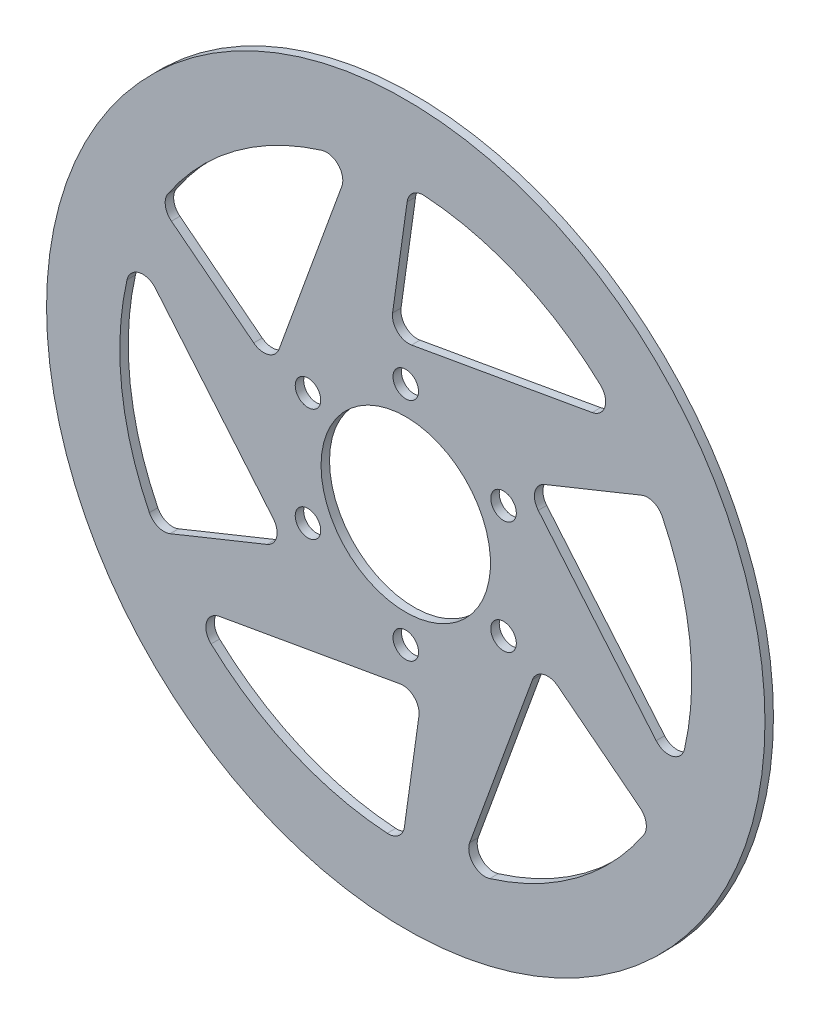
ISO-10303-21;
HEADER;
FILE_DESCRIPTION(('STEP AP214'),'2;1');
FILE_NAME('part.step','',(''),(''),'','','');
FILE_SCHEMA(('AUTOMOTIVE_DESIGN { 1 0 10303 214 1 1 1 1 }'));
ENDSEC;
DATA;
#1=APPLICATION_CONTEXT('core data for automotive mechanical design processes');
#2=APPLICATION_PROTOCOL_DEFINITION('international standard','automotive_design',2000,#1);
#3=PRODUCT_CONTEXT('',#1,'mechanical');
#4=PRODUCT('Part','Part','',(#3));
#5=PRODUCT_RELATED_PRODUCT_CATEGORY('part','',(#4));
#6=PRODUCT_DEFINITION_FORMATION('','',#4);
#7=PRODUCT_DEFINITION_CONTEXT('part definition',#1,'design');
#8=PRODUCT_DEFINITION('design','',#6,#7);
#9=PRODUCT_DEFINITION_SHAPE('','',#8);
#10=(LENGTH_UNIT() NAMED_UNIT(*) SI_UNIT(.MILLI.,.METRE.));
#11=(NAMED_UNIT(*) PLANE_ANGLE_UNIT() SI_UNIT($,.RADIAN.));
#12=(NAMED_UNIT(*) SI_UNIT($,.STERADIAN.) SOLID_ANGLE_UNIT());
#13=UNCERTAINTY_MEASURE_WITH_UNIT(LENGTH_MEASURE(1.E-05),#10,'distance_accuracy_value','');
#14=(GEOMETRIC_REPRESENTATION_CONTEXT(3) GLOBAL_UNCERTAINTY_ASSIGNED_CONTEXT((#13)) GLOBAL_UNIT_ASSIGNED_CONTEXT((#10,
#11,#12)) REPRESENTATION_CONTEXT('',''));
#15=CARTESIAN_POINT('',(0.,0.,0.));
#16=DIRECTION('',(0.,0.,1.));
#17=DIRECTION('',(1.,0.,0.));
#18=AXIS2_PLACEMENT_3D('',#15,#16,#17);
#19=CARTESIAN_POINT('',(0.,0.,1.651));
#20=DIRECTION('',(0.,0.,1.));
#21=DIRECTION('',(1.,0.,0.));
#22=AXIS2_PLACEMENT_3D('',#19,#20,#21);
#23=PLANE('',#22);
#24=CARTESIAN_POINT('',(0.,0.,1.651));
#25=DIRECTION('',(0.,0.,1.));
#26=DIRECTION('',(-0.499999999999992,0.866025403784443,0.));
#27=AXIS2_PLACEMENT_3D('',#24,#25,#26);
#28=CIRCLE('',#27,55.7252);
#29=CARTESIAN_POINT('',(-54.317059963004,12.4480886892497,1.651));
#30=VERTEX_POINT('',#29);
#31=CARTESIAN_POINT('',(-49.9657399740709,-24.6723072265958,1.651));
#32=VERTEX_POINT('',#31);
#33=EDGE_CURVE('E319',#30,#32,#28,.T.);
#34=ORIENTED_EDGE('',*,*,#33,.F.);
#35=CARTESIAN_POINT('',(-51.2222901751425,11.7388461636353,1.651));
#36=DIRECTION('',(0.,0.,1.));
#37=DIRECTION('',(0.499999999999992,-0.866025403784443,0.));
#38=AXIS2_PLACEMENT_3D('',#35,#36,#37);
#39=CIRCLE('',#38,3.17499999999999);
#40=CARTESIAN_POINT('',(-48.7900990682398,13.7796968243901,1.651));
#41=VERTEX_POINT('',#40);
#42=EDGE_CURVE('E317',#41,#30,#39,.T.);
#43=ORIENTED_EDGE('',*,*,#42,.F.);
#44=DIRECTION('',(-0.642787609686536,0.766044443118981,0.));
#45=VECTOR('',#44,1.);
#46=CARTESIAN_POINT('',(-48.7900990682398,13.7796968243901,1.651));
#47=LINE('',#46,#45);
#48=CARTESIAN_POINT('',(-25.8149342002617,-13.6010384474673,1.651));
#49=VERTEX_POINT('',#48);
#50=EDGE_CURVE('E329',#49,#41,#47,.T.);
#51=ORIENTED_EDGE('',*,*,#50,.F.);
#52=CARTESIAN_POINT('',(-28.2471253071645,-15.641889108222,1.651));
#53=DIRECTION('',(0.,0.,1.));
#54=DIRECTION('',(-0.499999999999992,0.866025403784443,0.));
#55=AXIS2_PLACEMENT_3D('',#52,#53,#54);
#56=CIRCLE('',#55,3.175);
#57=CARTESIAN_POINT('',(-27.057749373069,-18.5856978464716,1.651));
#58=VERTEX_POINT('',#57);
#59=EDGE_CURVE('E326',#58,#49,#56,.T.);
#60=ORIENTED_EDGE('',*,*,#59,.F.);
#61=DIRECTION('',(0.927183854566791,0.374606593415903,0.));
#62=VECTOR('',#61,1.);
#63=CARTESIAN_POINT('',(-27.057749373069,-18.5856978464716,1.651));
#64=LINE('',#63,#62);
#65=CARTESIAN_POINT('',(-45.9295151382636,-26.2103861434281,1.651));
#66=VERTEX_POINT('',#65);
#67=EDGE_CURVE('E324',#66,#58,#64,.T.);
#68=ORIENTED_EDGE('',*,*,#67,.F.);
#69=CARTESIAN_POINT('',(-47.118891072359,-23.2665774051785,1.651));
#70=DIRECTION('',(0.,0.,1.));
#71=DIRECTION('',(0.499999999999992,-0.866025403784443,0.));
#72=AXIS2_PLACEMENT_3D('',#69,#70,#71);
#73=CIRCLE('',#72,3.175);
#74=EDGE_CURVE('E322',#32,#66,#73,.T.);
#75=ORIENTED_EDGE('',*,*,#74,.F.);
#76=EDGE_LOOP('',(#34,#43,#51,#60,#68,#75));
#77=FACE_BOUND('',#76,.T.);
#78=CARTESIAN_POINT('',(0.,0.,1.651));
#79=DIRECTION('',(0.,0.,1.));
#80=DIRECTION('',(-0.500000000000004,-0.866025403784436,0.));
#81=AXIS2_PLACEMENT_3D('',#78,#79,#80);
#82=CIRCLE('',#81,55.7252);
#83=CARTESIAN_POINT('',(16.3781689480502,-53.2639981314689,1.651));
#84=VERTEX_POINT('',#83);
#85=CARTESIAN_POINT('',(46.3497148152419,-30.935446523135,1.651));
#86=VERTEX_POINT('',#85);
#87=EDGE_CURVE('E409',#84,#86,#82,.T.);
#88=ORIENTED_EDGE('',*,*,#87,.F.);
#89=CARTESIAN_POINT('',(15.4450060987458,-50.2292276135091,1.651));
#90=DIRECTION('',(0.,0.,1.));
#91=DIRECTION('',(0.500000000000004,0.866025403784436,0.));
#92=AXIS2_PLACEMENT_3D('',#89,#90,#91);
#93=CIRCLE('',#92,3.17499999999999);
#94=CARTESIAN_POINT('',(12.4614820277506,-49.1433136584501,1.651));
#95=VERTEX_POINT('',#94);
#96=EDGE_CURVE('E407',#95,#84,#93,.T.);
#97=ORIENTED_EDGE('',*,*,#96,.F.);
#98=DIRECTION('',(-0.342020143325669,-0.939692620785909,0.));
#99=VECTOR('',#98,1.);
#100=CARTESIAN_POINT('',(12.4614820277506,-49.1433136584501,1.651));
#101=LINE('',#100,#99);
#102=CARTESIAN_POINT('',(24.6863119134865,-15.5558695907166,1.651));
#103=VERTEX_POINT('',#102);
#104=EDGE_CURVE('E419',#103,#95,#101,.T.);
#105=ORIENTED_EDGE('',*,*,#104,.F.);
#106=CARTESIAN_POINT('',(27.6698359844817,-16.6417835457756,1.651));
#107=DIRECTION('',(0.,0.,1.));
#108=DIRECTION('',(-0.500000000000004,-0.866025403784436,0.));
#109=AXIS2_PLACEMENT_3D('',#106,#107,#108);
#110=CIRCLE('',#109,3.175);
#111=CARTESIAN_POINT('',(29.6245611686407,-14.1398494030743,1.651));
#112=VERTEX_POINT('',#111);
#113=EDGE_CURVE('E416',#112,#103,#110,.T.);
#114=ORIENTED_EDGE('',*,*,#113,.F.);
#115=DIRECTION('',(-0.788010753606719,0.615661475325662,0.));
#116=VECTOR('',#115,1.);
#117=CARTESIAN_POINT('',(29.6245611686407,-14.1398494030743,1.651));
#118=LINE('',#117,#116);
#119=CARTESIAN_POINT('',(45.6636178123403,-26.6709338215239,1.651));
#120=VERTEX_POINT('',#119);
#121=EDGE_CURVE('E414',#120,#112,#118,.T.);
#122=ORIENTED_EDGE('',*,*,#121,.F.);
#123=CARTESIAN_POINT('',(43.7088926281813,-29.1728679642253,1.651));
#124=DIRECTION('',(0.,0.,1.));
#125=DIRECTION('',(0.500000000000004,0.866025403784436,0.));
#126=AXIS2_PLACEMENT_3D('',#123,#124,#125);
#127=CIRCLE('',#126,3.175);
#128=EDGE_CURVE('E412',#86,#120,#127,.T.);
#129=ORIENTED_EDGE('',*,*,#128,.F.);
#130=EDGE_LOOP('',(#88,#97,#105,#114,#122,#129));
#131=FACE_BOUND('',#130,.T.);
#132=CARTESIAN_POINT('',(0.,0.,1.651));
#133=DIRECTION('',(0.,0.,1.));
#134=DIRECTION('',(1.,0.,0.));
#135=AXIS2_PLACEMENT_3D('',#132,#133,#134);
#136=CIRCLE('',#135,55.7252);
#137=CARTESIAN_POINT('',(37.9388910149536,40.8159094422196,1.651));
#138=VERTEX_POINT('',#137);
#139=CARTESIAN_POINT('',(3.61602515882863,55.607753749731,1.651));
#140=VERTEX_POINT('',#139);
#141=EDGE_CURVE('E499',#138,#140,#136,.T.);
#142=ORIENTED_EDGE('',*,*,#141,.F.);
#143=CARTESIAN_POINT('',(35.7772840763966,38.4903814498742,1.651));
#144=DIRECTION('',(0.,0.,1.));
#145=DIRECTION('',(-1.,0.,0.));
#146=AXIS2_PLACEMENT_3D('',#143,#144,#145);
#147=CIRCLE('',#146,3.17499999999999);
#148=CARTESIAN_POINT('',(36.3286170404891,35.3636168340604,1.651));
#149=VERTEX_POINT('',#148);
#150=EDGE_CURVE('E497',#149,#138,#147,.T.);
#151=ORIENTED_EDGE('',*,*,#150,.F.);
#152=DIRECTION('',(0.984807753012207,0.173648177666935,0.));
#153=VECTOR('',#152,1.);
#154=CARTESIAN_POINT('',(36.3286170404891,35.3636168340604,1.651));
#155=LINE('',#154,#153);
#156=CARTESIAN_POINT('',(1.12862228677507,29.156908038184,1.651));
#157=VERTEX_POINT('',#156);
#158=EDGE_CURVE('E509',#157,#149,#155,.T.);
#159=ORIENTED_EDGE('',*,*,#158,.F.);
#160=CARTESIAN_POINT('',(0.577289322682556,32.2836726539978,1.651));
#161=DIRECTION('',(0.,0.,1.));
#162=DIRECTION('',(1.,0.,0.));
#163=AXIS2_PLACEMENT_3D('',#160,#161,#162);
#164=CIRCLE('',#163,3.175);
#165=CARTESIAN_POINT('',(-2.56681179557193,32.725547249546,1.651));
#166=VERTEX_POINT('',#165);
#167=EDGE_CURVE('E506',#166,#157,#164,.T.);
#168=ORIENTED_EDGE('',*,*,#167,.F.);
#169=DIRECTION('',(-0.139173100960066,-0.99026806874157,0.));
#170=VECTOR('',#169,1.);
#171=CARTESIAN_POINT('',(-2.56681179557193,32.725547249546,1.651));
#172=LINE('',#171,#170);
#173=CARTESIAN_POINT('',(0.265897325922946,52.8813199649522,1.651));
#174=VERTEX_POINT('',#173);
#175=EDGE_CURVE('E504',#174,#166,#172,.T.);
#176=ORIENTED_EDGE('',*,*,#175,.F.);
#177=CARTESIAN_POINT('',(3.40999844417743,52.439445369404,1.651));
#178=DIRECTION('',(0.,0.,1.));
#179=DIRECTION('',(-1.,0.,0.));
#180=AXIS2_PLACEMENT_3D('',#177,#178,#179);
#181=CIRCLE('',#180,3.175);
#182=EDGE_CURVE('E502',#140,#174,#181,.T.);
#183=ORIENTED_EDGE('',*,*,#182,.F.);
#184=EDGE_LOOP('',(#142,#151,#159,#168,#176,#183));
#185=FACE_BOUND('',#184,.T.);
#186=CARTESIAN_POINT('',(-19.0525588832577,-10.9999999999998,1.651));
#187=DIRECTION('',(0.,0.,1.));
#188=DIRECTION('',(-0.499999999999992,0.866025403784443,0.));
#189=AXIS2_PLACEMENT_3D('',#186,#187,#188);
#190=CIRCLE('',#189,2.4892);
#191=CARTESIAN_POINT('',(-21.5417588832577,-10.9999999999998,1.651));
#192=VERTEX_POINT('',#191);
#193=EDGE_CURVE('E548',#192,#192,#190,.T.);
#194=ORIENTED_EDGE('',*,*,#193,.F.);
#195=EDGE_LOOP('',(#194));
#196=FACE_BOUND('',#195,.T.);
#197=CARTESIAN_POINT('',(19.0525588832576,-11.0000000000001,1.651));
#198=DIRECTION('',(0.,0.,1.));
#199=DIRECTION('',(-0.500000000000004,-0.866025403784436,0.));
#200=AXIS2_PLACEMENT_3D('',#197,#198,#199);
#201=CIRCLE('',#200,2.4892);
#202=CARTESIAN_POINT('',(16.5633588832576,-11.0000000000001,1.651));
#203=VERTEX_POINT('',#202);
#204=EDGE_CURVE('E560',#203,#203,#201,.T.);
#205=ORIENTED_EDGE('',*,*,#204,.F.);
#206=EDGE_LOOP('',(#205));
#207=FACE_BOUND('',#206,.T.);
#208=CARTESIAN_POINT('',(0.,22.,1.651));
#209=DIRECTION('',(0.,0.,1.));
#210=DIRECTION('',(1.,0.,0.));
#211=AXIS2_PLACEMENT_3D('',#208,#209,#210);
#212=CIRCLE('',#211,2.4892);
#213=CARTESIAN_POINT('',(-2.4892,22.,1.651));
#214=VERTEX_POINT('',#213);
#215=EDGE_CURVE('E572',#214,#214,#212,.T.);
#216=ORIENTED_EDGE('',*,*,#215,.F.);
#217=EDGE_LOOP('',(#216));
#218=FACE_BOUND('',#217,.T.);
#219=CARTESIAN_POINT('',(0.,0.,1.651));
#220=DIRECTION('',(0.,0.,1.));
#221=DIRECTION('',(1.,0.,0.));
#222=AXIS2_PLACEMENT_3D('',#219,#220,#221);
#223=CIRCLE('',#222,70.);
#224=CARTESIAN_POINT('',(-70.,0.,1.651));
#225=VERTEX_POINT('',#224);
#226=EDGE_CURVE('E11',#225,#225,#223,.T.);
#227=ORIENTED_EDGE('',*,*,#226,.T.);
#228=EDGE_LOOP('',(#227));
#229=FACE_BOUND('',#228,.T.);
#230=CARTESIAN_POINT('',(0.,0.,1.651));
#231=DIRECTION('',(0.,0.,1.));
#232=DIRECTION('',(1.,0.,0.));
#233=AXIS2_PLACEMENT_3D('',#230,#231,#232);
#234=CIRCLE('',#233,16.51);
#235=CARTESIAN_POINT('',(-16.51,0.,1.651));
#236=VERTEX_POINT('',#235);
#237=EDGE_CURVE('E578',#236,#236,#234,.T.);
#238=ORIENTED_EDGE('',*,*,#237,.F.);
#239=EDGE_LOOP('',(#238));
#240=FACE_BOUND('',#239,.T.);
#241=CARTESIAN_POINT('',(19.0525588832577,11.,1.651));
#242=DIRECTION('',(0.,0.,1.));
#243=DIRECTION('',(0.499999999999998,-0.86602540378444,0.));
#244=AXIS2_PLACEMENT_3D('',#241,#242,#243);
#245=CIRCLE('',#244,2.4892);
#246=CARTESIAN_POINT('',(16.5633588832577,11.,1.651));
#247=VERTEX_POINT('',#246);
#248=EDGE_CURVE('E566',#247,#247,#245,.T.);
#249=ORIENTED_EDGE('',*,*,#248,.F.);
#250=EDGE_LOOP('',(#249));
#251=FACE_BOUND('',#250,.T.);
#252=CARTESIAN_POINT('',(0.,-22.,1.651));
#253=DIRECTION('',(0.,0.,1.));
#254=DIRECTION('',(-1.,0.,0.));
#255=AXIS2_PLACEMENT_3D('',#252,#253,#254);
#256=CIRCLE('',#255,2.4892);
#257=CARTESIAN_POINT('',(-2.4892,-22.,1.651));
#258=VERTEX_POINT('',#257);
#259=EDGE_CURVE('E554',#258,#258,#256,.T.);
#260=ORIENTED_EDGE('',*,*,#259,.F.);
#261=EDGE_LOOP('',(#260));
#262=FACE_BOUND('',#261,.T.);
#263=CARTESIAN_POINT('',(-19.0525588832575,11.0000000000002,1.651));
#264=DIRECTION('',(0.,0.,1.));
#265=DIRECTION('',(0.50000000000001,0.866025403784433,0.));
#266=AXIS2_PLACEMENT_3D('',#263,#264,#265);
#267=CIRCLE('',#266,2.4892);
#268=CARTESIAN_POINT('',(-21.5417588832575,11.0000000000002,1.651));
#269=VERTEX_POINT('',#268);
#270=EDGE_CURVE('E542',#269,#269,#267,.T.);
#271=ORIENTED_EDGE('',*,*,#270,.F.);
#272=EDGE_LOOP('',(#271));
#273=FACE_BOUND('',#272,.T.);
#274=CARTESIAN_POINT('',(0.,0.,1.651));
#275=DIRECTION('',(0.,0.,1.));
#276=DIRECTION('',(0.499999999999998,-0.86602540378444,0.));
#277=AXIS2_PLACEMENT_3D('',#274,#275,#276);
#278=CIRCLE('',#277,55.7252);
#279=CARTESIAN_POINT('',(54.3170599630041,-12.4480886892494,1.651));
#280=VERTEX_POINT('',#279);
#281=CARTESIAN_POINT('',(49.9657399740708,24.6723072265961,1.651));
#282=VERTEX_POINT('',#281);
#283=EDGE_CURVE('E454',#280,#282,#278,.T.);
#284=ORIENTED_EDGE('',*,*,#283,.F.);
#285=CARTESIAN_POINT('',(51.2222901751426,-11.738846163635,1.651));
#286=DIRECTION('',(0.,0.,1.));
#287=DIRECTION('',(-0.499999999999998,0.86602540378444,0.));
#288=AXIS2_PLACEMENT_3D('',#285,#286,#287);
#289=CIRCLE('',#288,3.17499999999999);
#290=CARTESIAN_POINT('',(48.7900990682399,-13.7796968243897,1.651));
#291=VERTEX_POINT('',#290);
#292=EDGE_CURVE('E452',#291,#280,#289,.T.);
#293=ORIENTED_EDGE('',*,*,#292,.F.);
#294=DIRECTION('',(0.642787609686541,-0.766044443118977,0.));
#295=VECTOR('',#294,1.);
#296=CARTESIAN_POINT('',(48.7900990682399,-13.7796968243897,1.651));
#297=LINE('',#296,#295);
#298=CARTESIAN_POINT('',(25.8149342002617,13.6010384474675,1.651));
#299=VERTEX_POINT('',#298);
#300=EDGE_CURVE('E464',#299,#291,#297,.T.);
#301=ORIENTED_EDGE('',*,*,#300,.F.);
#302=CARTESIAN_POINT('',(28.2471253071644,15.6418891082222,1.651));
#303=DIRECTION('',(0.,0.,1.));
#304=DIRECTION('',(0.499999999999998,-0.86602540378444,0.));
#305=AXIS2_PLACEMENT_3D('',#302,#303,#304);
#306=CIRCLE('',#305,3.175);
#307=CARTESIAN_POINT('',(27.0577493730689,18.5856978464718,1.651));
#308=VERTEX_POINT('',#307);
#309=EDGE_CURVE('E461',#308,#299,#306,.T.);
#310=ORIENTED_EDGE('',*,*,#309,.F.);
#311=DIRECTION('',(-0.927183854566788,-0.37460659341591,0.));
#312=VECTOR('',#311,1.);
#313=CARTESIAN_POINT('',(27.0577493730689,18.5856978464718,1.651));
#314=LINE('',#313,#312);
#315=CARTESIAN_POINT('',(45.9295151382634,26.2103861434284,1.651));
#316=VERTEX_POINT('',#315);
#317=EDGE_CURVE('E459',#316,#308,#314,.T.);
#318=ORIENTED_EDGE('',*,*,#317,.F.);
#319=CARTESIAN_POINT('',(47.1188910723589,23.2665774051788,1.651));
#320=DIRECTION('',(0.,0.,1.));
#321=DIRECTION('',(-0.499999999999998,0.86602540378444,0.));
#322=AXIS2_PLACEMENT_3D('',#319,#320,#321);
#323=CIRCLE('',#322,3.175);
#324=EDGE_CURVE('E457',#282,#316,#323,.T.);
#325=ORIENTED_EDGE('',*,*,#324,.F.);
#326=EDGE_LOOP('',(#284,#293,#301,#310,#318,#325));
#327=FACE_BOUND('',#326,.T.);
#328=CARTESIAN_POINT('',(0.,0.,1.651));
#329=DIRECTION('',(0.,0.,1.));
#330=DIRECTION('',(-1.,0.,0.));
#331=AXIS2_PLACEMENT_3D('',#328,#329,#330);
#332=CIRCLE('',#331,55.7252);
#333=CARTESIAN_POINT('',(-37.9388910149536,-40.8159094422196,1.651));
#334=VERTEX_POINT('',#333);
#335=CARTESIAN_POINT('',(-3.61602515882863,-55.607753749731,1.651));
#336=VERTEX_POINT('',#335);
#337=EDGE_CURVE('E364',#334,#336,#332,.T.);
#338=ORIENTED_EDGE('',*,*,#337,.F.);
#339=CARTESIAN_POINT('',(-35.7772840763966,-38.4903814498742,1.651));
#340=DIRECTION('',(0.,0.,1.));
#341=DIRECTION('',(1.,0.,0.));
#342=AXIS2_PLACEMENT_3D('',#339,#340,#341);
#343=CIRCLE('',#342,3.17499999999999);
#344=CARTESIAN_POINT('',(-36.3286170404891,-35.3636168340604,1.651));
#345=VERTEX_POINT('',#344);
#346=EDGE_CURVE('E362',#345,#334,#343,.T.);
#347=ORIENTED_EDGE('',*,*,#346,.F.);
#348=DIRECTION('',(-0.984807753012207,-0.173648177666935,0.));
#349=VECTOR('',#348,1.);
#350=CARTESIAN_POINT('',(-36.3286170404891,-35.3636168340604,1.651));
#351=LINE('',#350,#349);
#352=CARTESIAN_POINT('',(-1.12862228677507,-29.156908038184,1.651));
#353=VERTEX_POINT('',#352);
#354=EDGE_CURVE('E374',#353,#345,#351,.T.);
#355=ORIENTED_EDGE('',*,*,#354,.F.);
#356=CARTESIAN_POINT('',(-0.577289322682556,-32.2836726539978,1.651));
#357=DIRECTION('',(0.,0.,1.));
#358=DIRECTION('',(-1.,0.,0.));
#359=AXIS2_PLACEMENT_3D('',#356,#357,#358);
#360=CIRCLE('',#359,3.175);
#361=CARTESIAN_POINT('',(2.56681179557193,-32.725547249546,1.651));
#362=VERTEX_POINT('',#361);
#363=EDGE_CURVE('E371',#362,#353,#360,.T.);
#364=ORIENTED_EDGE('',*,*,#363,.F.);
#365=DIRECTION('',(0.139173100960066,0.99026806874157,0.));
#366=VECTOR('',#365,1.);
#367=CARTESIAN_POINT('',(2.56681179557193,-32.725547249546,1.651));
#368=LINE('',#367,#366);
#369=CARTESIAN_POINT('',(-0.265897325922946,-52.8813199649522,1.651));
#370=VERTEX_POINT('',#369);
#371=EDGE_CURVE('E369',#370,#362,#368,.T.);
#372=ORIENTED_EDGE('',*,*,#371,.F.);
#373=CARTESIAN_POINT('',(-3.40999844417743,-52.439445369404,1.651));
#374=DIRECTION('',(0.,0.,1.));
#375=DIRECTION('',(1.,0.,0.));
#376=AXIS2_PLACEMENT_3D('',#373,#374,#375);
#377=CIRCLE('',#376,3.175);
#378=EDGE_CURVE('E367',#336,#370,#377,.T.);
#379=ORIENTED_EDGE('',*,*,#378,.F.);
#380=EDGE_LOOP('',(#338,#347,#355,#364,#372,#379));
#381=FACE_BOUND('',#380,.T.);
#382=CARTESIAN_POINT('',(0.,0.,1.651));
#383=DIRECTION('',(0.,0.,1.));
#384=DIRECTION('',(0.50000000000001,0.866025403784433,0.));
#385=AXIS2_PLACEMENT_3D('',#382,#383,#384);
#386=CIRCLE('',#385,55.7252);
#387=CARTESIAN_POINT('',(-16.3781689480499,53.263998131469,1.651));
#388=VERTEX_POINT('',#387);
#389=CARTESIAN_POINT('',(-46.3497148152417,30.9354465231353,1.651));
#390=VERTEX_POINT('',#389);
#391=EDGE_CURVE('E274',#388,#390,#386,.T.);
#392=ORIENTED_EDGE('',*,*,#391,.F.);
#393=CARTESIAN_POINT('',(-15.4450060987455,50.2292276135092,1.651));
#394=DIRECTION('',(0.,0.,1.));
#395=DIRECTION('',(-0.50000000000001,-0.866025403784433,0.));
#396=AXIS2_PLACEMENT_3D('',#393,#394,#395);
#397=CIRCLE('',#396,3.17499999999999);
#398=CARTESIAN_POINT('',(-12.4614820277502,49.1433136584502,1.651));
#399=VERTEX_POINT('',#398);
#400=EDGE_CURVE('E266',#399,#388,#397,.T.);
#401=ORIENTED_EDGE('',*,*,#400,.F.);
#402=DIRECTION('',(0.342020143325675,0.939692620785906,0.));
#403=VECTOR('',#402,1.);
#404=CARTESIAN_POINT('',(-12.4614820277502,49.1433136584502,1.651));
#405=LINE('',#404,#403);
#406=CARTESIAN_POINT('',(-24.6863119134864,15.5558695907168,1.651));
#407=VERTEX_POINT('',#406);
#408=EDGE_CURVE('E295',#407,#399,#405,.T.);
#409=ORIENTED_EDGE('',*,*,#408,.F.);
#410=CARTESIAN_POINT('',(-27.6698359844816,16.6417835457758,1.651));
#411=DIRECTION('',(0.,0.,1.));
#412=DIRECTION('',(0.50000000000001,0.866025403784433,0.));
#413=AXIS2_PLACEMENT_3D('',#410,#411,#412);
#414=CIRCLE('',#413,3.175);
#415=CARTESIAN_POINT('',(-29.6245611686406,14.1398494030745,1.651));
#416=VERTEX_POINT('',#415);
#417=EDGE_CURVE('E293',#416,#407,#414,.T.);
#418=ORIENTED_EDGE('',*,*,#417,.F.);
#419=DIRECTION('',(0.788010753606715,-0.615661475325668,0.));
#420=VECTOR('',#419,1.);
#421=CARTESIAN_POINT('',(-29.6245611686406,14.1398494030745,1.651));
#422=LINE('',#421,#420);
#423=CARTESIAN_POINT('',(-45.6636178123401,26.6709338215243,1.651));
#424=VERTEX_POINT('',#423);
#425=EDGE_CURVE('E289',#424,#416,#422,.T.);
#426=ORIENTED_EDGE('',*,*,#425,.F.);
#427=CARTESIAN_POINT('',(-43.7088926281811,29.1728679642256,1.651));
#428=DIRECTION('',(0.,0.,1.));
#429=DIRECTION('',(-0.50000000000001,-0.866025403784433,0.));
#430=AXIS2_PLACEMENT_3D('',#427,#428,#429);
#431=CIRCLE('',#430,3.175);
#432=EDGE_CURVE('E287',#390,#424,#431,.T.);
#433=ORIENTED_EDGE('',*,*,#432,.F.);
#434=EDGE_LOOP('',(#392,#401,#409,#418,#426,#433));
#435=FACE_BOUND('',#434,.T.);
#436=ADVANCED_FACE('F33',(#77,#131,#185,#196,#207,#218,#229,#240,#251,#262,#273,#327,#381,#435),
#23,.T.);
#437=CARTESIAN_POINT('',(0.,0.,0.));
#438=DIRECTION('',(0.,0.,1.));
#439=DIRECTION('',(1.,0.,0.));
#440=AXIS2_PLACEMENT_3D('',#437,#438,#439);
#441=PLANE('',#440);
#442=CARTESIAN_POINT('',(-51.2222901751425,11.7388461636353,0.));
#443=DIRECTION('',(0.,0.,1.));
#444=DIRECTION('',(0.499999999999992,-0.866025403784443,0.));
#445=AXIS2_PLACEMENT_3D('',#442,#443,#444);
#446=CIRCLE('',#445,3.17499999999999);
#447=CARTESIAN_POINT('',(-48.7900990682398,13.7796968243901,0.));
#448=VERTEX_POINT('',#447);
#449=CARTESIAN_POINT('',(-54.317059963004,12.4480886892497,0.));
#450=VERTEX_POINT('',#449);
#451=EDGE_CURVE('E282',#448,#450,#446,.T.);
#452=ORIENTED_EDGE('',*,*,#451,.T.);
#453=CARTESIAN_POINT('',(0.,0.,0.));
#454=DIRECTION('',(0.,0.,1.));
#455=DIRECTION('',(-0.499999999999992,0.866025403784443,0.));
#456=AXIS2_PLACEMENT_3D('',#453,#454,#455);
#457=CIRCLE('',#456,55.7252);
#458=CARTESIAN_POINT('',(-49.9657399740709,-24.6723072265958,0.));
#459=VERTEX_POINT('',#458);
#460=EDGE_CURVE('E334',#450,#459,#457,.T.);
#461=ORIENTED_EDGE('',*,*,#460,.T.);
#462=CARTESIAN_POINT('',(-47.118891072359,-23.2665774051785,0.));
#463=DIRECTION('',(0.,0.,1.));
#464=DIRECTION('',(0.499999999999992,-0.866025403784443,0.));
#465=AXIS2_PLACEMENT_3D('',#462,#463,#464);
#466=CIRCLE('',#465,3.175);
#467=CARTESIAN_POINT('',(-45.9295151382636,-26.2103861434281,0.));
#468=VERTEX_POINT('',#467);
#469=EDGE_CURVE('E337',#459,#468,#466,.T.);
#470=ORIENTED_EDGE('',*,*,#469,.T.);
#471=DIRECTION('',(0.927183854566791,0.374606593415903,0.));
#472=VECTOR('',#471,1.);
#473=CARTESIAN_POINT('',(-27.057749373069,-18.5856978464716,0.));
#474=LINE('',#473,#472);
#475=CARTESIAN_POINT('',(-27.057749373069,-18.5856978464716,0.));
#476=VERTEX_POINT('',#475);
#477=EDGE_CURVE('E340',#468,#476,#474,.T.);
#478=ORIENTED_EDGE('',*,*,#477,.T.);
#479=CARTESIAN_POINT('',(-28.2471253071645,-15.641889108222,0.));
#480=DIRECTION('',(0.,0.,1.));
#481=DIRECTION('',(-0.499999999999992,0.866025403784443,0.));
#482=AXIS2_PLACEMENT_3D('',#479,#480,#481);
#483=CIRCLE('',#482,3.175);
#484=CARTESIAN_POINT('',(-25.8149342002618,-13.6010384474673,0.));
#485=VERTEX_POINT('',#484);
#486=EDGE_CURVE('E343',#476,#485,#483,.T.);
#487=ORIENTED_EDGE('',*,*,#486,.T.);
#488=DIRECTION('',(-0.642787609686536,0.766044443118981,0.));
#489=VECTOR('',#488,1.);
#490=CARTESIAN_POINT('',(-48.7900990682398,13.7796968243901,0.));
#491=LINE('',#490,#489);
#492=EDGE_CURVE('E320',#485,#448,#491,.T.);
#493=ORIENTED_EDGE('',*,*,#492,.T.);
#494=EDGE_LOOP('',(#452,#461,#470,#478,#487,#493));
#495=FACE_BOUND('',#494,.T.);
#496=CARTESIAN_POINT('',(15.4450060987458,-50.2292276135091,0.));
#497=DIRECTION('',(0.,0.,1.));
#498=DIRECTION('',(0.500000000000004,0.866025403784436,0.));
#499=AXIS2_PLACEMENT_3D('',#496,#497,#498);
#500=CIRCLE('',#499,3.17499999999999);
#501=CARTESIAN_POINT('',(12.4614820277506,-49.1433136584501,0.));
#502=VERTEX_POINT('',#501);
#503=CARTESIAN_POINT('',(16.3781689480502,-53.2639981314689,0.));
#504=VERTEX_POINT('',#503);
#505=EDGE_CURVE('E406',#502,#504,#500,.T.);
#506=ORIENTED_EDGE('',*,*,#505,.T.);
#507=CARTESIAN_POINT('',(0.,0.,0.));
#508=DIRECTION('',(0.,0.,1.));
#509=DIRECTION('',(-0.500000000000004,-0.866025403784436,0.));
#510=AXIS2_PLACEMENT_3D('',#507,#508,#509);
#511=CIRCLE('',#510,55.7252);
#512=CARTESIAN_POINT('',(46.3497148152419,-30.935446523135,0.));
#513=VERTEX_POINT('',#512);
#514=EDGE_CURVE('E424',#504,#513,#511,.T.);
#515=ORIENTED_EDGE('',*,*,#514,.T.);
#516=CARTESIAN_POINT('',(43.7088926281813,-29.1728679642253,0.));
#517=DIRECTION('',(0.,0.,1.));
#518=DIRECTION('',(0.500000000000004,0.866025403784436,0.));
#519=AXIS2_PLACEMENT_3D('',#516,#517,#518);
#520=CIRCLE('',#519,3.175);
#521=CARTESIAN_POINT('',(45.6636178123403,-26.6709338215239,0.));
#522=VERTEX_POINT('',#521);
#523=EDGE_CURVE('E427',#513,#522,#520,.T.);
#524=ORIENTED_EDGE('',*,*,#523,.T.);
#525=DIRECTION('',(-0.788010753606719,0.615661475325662,0.));
#526=VECTOR('',#525,1.);
#527=CARTESIAN_POINT('',(29.6245611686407,-14.1398494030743,0.));
#528=LINE('',#527,#526);
#529=CARTESIAN_POINT('',(29.6245611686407,-14.1398494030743,0.));
#530=VERTEX_POINT('',#529);
#531=EDGE_CURVE('E430',#522,#530,#528,.T.);
#532=ORIENTED_EDGE('',*,*,#531,.T.);
#533=CARTESIAN_POINT('',(27.6698359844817,-16.6417835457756,0.));
#534=DIRECTION('',(0.,0.,1.));
#535=DIRECTION('',(-0.500000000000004,-0.866025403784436,0.));
#536=AXIS2_PLACEMENT_3D('',#533,#534,#535);
#537=CIRCLE('',#536,3.175);
#538=CARTESIAN_POINT('',(24.6863119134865,-15.5558695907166,0.));
#539=VERTEX_POINT('',#538);
#540=EDGE_CURVE('E433',#530,#539,#537,.T.);
#541=ORIENTED_EDGE('',*,*,#540,.T.);
#542=DIRECTION('',(-0.342020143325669,-0.939692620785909,0.));
#543=VECTOR('',#542,1.);
#544=CARTESIAN_POINT('',(12.4614820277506,-49.1433136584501,0.));
#545=LINE('',#544,#543);
#546=EDGE_CURVE('E410',#539,#502,#545,.T.);
#547=ORIENTED_EDGE('',*,*,#546,.T.);
#548=EDGE_LOOP('',(#506,#515,#524,#532,#541,#547));
#549=FACE_BOUND('',#548,.T.);
#550=CARTESIAN_POINT('',(35.7772840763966,38.4903814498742,0.));
#551=DIRECTION('',(0.,0.,1.));
#552=DIRECTION('',(-1.,0.,0.));
#553=AXIS2_PLACEMENT_3D('',#550,#551,#552);
#554=CIRCLE('',#553,3.17499999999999);
#555=CARTESIAN_POINT('',(36.3286170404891,35.3636168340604,0.));
#556=VERTEX_POINT('',#555);
#557=CARTESIAN_POINT('',(37.9388910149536,40.8159094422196,0.));
#558=VERTEX_POINT('',#557);
#559=EDGE_CURVE('E496',#556,#558,#554,.T.);
#560=ORIENTED_EDGE('',*,*,#559,.T.);
#561=CARTESIAN_POINT('',(0.,0.,0.));
#562=DIRECTION('',(0.,0.,1.));
#563=DIRECTION('',(1.,0.,0.));
#564=AXIS2_PLACEMENT_3D('',#561,#562,#563);
#565=CIRCLE('',#564,55.7252);
#566=CARTESIAN_POINT('',(3.61602515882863,55.607753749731,0.));
#567=VERTEX_POINT('',#566);
#568=EDGE_CURVE('E514',#558,#567,#565,.T.);
#569=ORIENTED_EDGE('',*,*,#568,.T.);
#570=CARTESIAN_POINT('',(3.40999844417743,52.439445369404,0.));
#571=DIRECTION('',(0.,0.,1.));
#572=DIRECTION('',(-1.,0.,0.));
#573=AXIS2_PLACEMENT_3D('',#570,#571,#572);
#574=CIRCLE('',#573,3.175);
#575=CARTESIAN_POINT('',(0.265897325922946,52.8813199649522,0.));
#576=VERTEX_POINT('',#575);
#577=EDGE_CURVE('E517',#567,#576,#574,.T.);
#578=ORIENTED_EDGE('',*,*,#577,.T.);
#579=DIRECTION('',(-0.139173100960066,-0.99026806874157,0.));
#580=VECTOR('',#579,1.);
#581=CARTESIAN_POINT('',(-2.56681179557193,32.725547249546,0.));
#582=LINE('',#581,#580);
#583=CARTESIAN_POINT('',(-2.56681179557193,32.725547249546,0.));
#584=VERTEX_POINT('',#583);
#585=EDGE_CURVE('E520',#576,#584,#582,.T.);
#586=ORIENTED_EDGE('',*,*,#585,.T.);
#587=CARTESIAN_POINT('',(0.577289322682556,32.2836726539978,0.));
#588=DIRECTION('',(0.,0.,1.));
#589=DIRECTION('',(1.,0.,0.));
#590=AXIS2_PLACEMENT_3D('',#587,#588,#589);
#591=CIRCLE('',#590,3.175);
#592=CARTESIAN_POINT('',(1.12862228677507,29.1569080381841,0.));
#593=VERTEX_POINT('',#592);
#594=EDGE_CURVE('E523',#584,#593,#591,.T.);
#595=ORIENTED_EDGE('',*,*,#594,.T.);
#596=DIRECTION('',(0.984807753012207,0.173648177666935,0.));
#597=VECTOR('',#596,1.);
#598=CARTESIAN_POINT('',(36.3286170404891,35.3636168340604,0.));
#599=LINE('',#598,#597);
#600=EDGE_CURVE('E500',#593,#556,#599,.T.);
#601=ORIENTED_EDGE('',*,*,#600,.T.);
#602=EDGE_LOOP('',(#560,#569,#578,#586,#595,#601));
#603=FACE_BOUND('',#602,.T.);
#604=CARTESIAN_POINT('',(-19.0525588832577,-10.9999999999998,0.));
#605=DIRECTION('',(0.,0.,1.));
#606=DIRECTION('',(-0.499999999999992,0.866025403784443,0.));
#607=AXIS2_PLACEMENT_3D('',#604,#605,#606);
#608=CIRCLE('',#607,2.4892);
#609=CARTESIAN_POINT('',(-21.5417588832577,-10.9999999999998,0.));
#610=VERTEX_POINT('',#609);
#611=EDGE_CURVE('E545',#610,#610,#608,.T.);
#612=ORIENTED_EDGE('',*,*,#611,.T.);
#613=EDGE_LOOP('',(#612));
#614=FACE_BOUND('',#613,.T.);
#615=CARTESIAN_POINT('',(19.0525588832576,-11.0000000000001,0.));
#616=DIRECTION('',(0.,0.,1.));
#617=DIRECTION('',(-0.500000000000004,-0.866025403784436,0.));
#618=AXIS2_PLACEMENT_3D('',#615,#616,#617);
#619=CIRCLE('',#618,2.4892);
#620=CARTESIAN_POINT('',(16.5633588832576,-11.0000000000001,0.));
#621=VERTEX_POINT('',#620);
#622=EDGE_CURVE('E557',#621,#621,#619,.T.);
#623=ORIENTED_EDGE('',*,*,#622,.T.);
#624=EDGE_LOOP('',(#623));
#625=FACE_BOUND('',#624,.T.);
#626=CARTESIAN_POINT('',(0.,22.,0.));
#627=DIRECTION('',(0.,0.,1.));
#628=DIRECTION('',(1.,0.,0.));
#629=AXIS2_PLACEMENT_3D('',#626,#627,#628);
#630=CIRCLE('',#629,2.4892);
#631=CARTESIAN_POINT('',(-2.4892,22.,0.));
#632=VERTEX_POINT('',#631);
#633=EDGE_CURVE('E569',#632,#632,#630,.T.);
#634=ORIENTED_EDGE('',*,*,#633,.T.);
#635=EDGE_LOOP('',(#634));
#636=FACE_BOUND('',#635,.T.);
#637=CARTESIAN_POINT('',(0.,0.,0.));
#638=DIRECTION('',(0.,0.,1.));
#639=DIRECTION('',(1.,0.,0.));
#640=AXIS2_PLACEMENT_3D('',#637,#638,#639);
#641=CIRCLE('',#640,70.);
#642=CARTESIAN_POINT('',(-70.,0.,0.));
#643=VERTEX_POINT('',#642);
#644=EDGE_CURVE('E37',#643,#643,#641,.T.);
#645=ORIENTED_EDGE('',*,*,#644,.F.);
#646=EDGE_LOOP('',(#645));
#647=FACE_BOUND('',#646,.T.);
#648=CARTESIAN_POINT('',(0.,0.,0.));
#649=DIRECTION('',(0.,0.,1.));
#650=DIRECTION('',(1.,0.,0.));
#651=AXIS2_PLACEMENT_3D('',#648,#649,#650);
#652=CIRCLE('',#651,16.51);
#653=CARTESIAN_POINT('',(-16.51,0.,0.));
#654=VERTEX_POINT('',#653);
#655=EDGE_CURVE('E575',#654,#654,#652,.T.);
#656=ORIENTED_EDGE('',*,*,#655,.T.);
#657=EDGE_LOOP('',(#656));
#658=FACE_BOUND('',#657,.T.);
#659=CARTESIAN_POINT('',(19.0525588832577,11.,0.));
#660=DIRECTION('',(0.,0.,1.));
#661=DIRECTION('',(0.499999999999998,-0.86602540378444,0.));
#662=AXIS2_PLACEMENT_3D('',#659,#660,#661);
#663=CIRCLE('',#662,2.4892);
#664=CARTESIAN_POINT('',(16.5633588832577,11.,0.));
#665=VERTEX_POINT('',#664);
#666=EDGE_CURVE('E563',#665,#665,#663,.T.);
#667=ORIENTED_EDGE('',*,*,#666,.T.);
#668=EDGE_LOOP('',(#667));
#669=FACE_BOUND('',#668,.T.);
#670=CARTESIAN_POINT('',(0.,-22.,0.));
#671=DIRECTION('',(0.,0.,1.));
#672=DIRECTION('',(-1.,0.,0.));
#673=AXIS2_PLACEMENT_3D('',#670,#671,#672);
#674=CIRCLE('',#673,2.4892);
#675=CARTESIAN_POINT('',(-2.4892,-22.,0.));
#676=VERTEX_POINT('',#675);
#677=EDGE_CURVE('E551',#676,#676,#674,.T.);
#678=ORIENTED_EDGE('',*,*,#677,.T.);
#679=EDGE_LOOP('',(#678));
#680=FACE_BOUND('',#679,.T.);
#681=CARTESIAN_POINT('',(-19.0525588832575,11.0000000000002,0.));
#682=DIRECTION('',(0.,0.,1.));
#683=DIRECTION('',(0.50000000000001,0.866025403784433,0.));
#684=AXIS2_PLACEMENT_3D('',#681,#682,#683);
#685=CIRCLE('',#684,2.4892);
#686=CARTESIAN_POINT('',(-21.5417588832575,11.0000000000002,0.));
#687=VERTEX_POINT('',#686);
#688=EDGE_CURVE('E541',#687,#687,#685,.T.);
#689=ORIENTED_EDGE('',*,*,#688,.T.);
#690=EDGE_LOOP('',(#689));
#691=FACE_BOUND('',#690,.T.);
#692=CARTESIAN_POINT('',(51.2222901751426,-11.738846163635,0.));
#693=DIRECTION('',(0.,0.,1.));
#694=DIRECTION('',(-0.499999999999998,0.86602540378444,0.));
#695=AXIS2_PLACEMENT_3D('',#692,#693,#694);
#696=CIRCLE('',#695,3.17499999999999);
#697=CARTESIAN_POINT('',(48.7900990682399,-13.7796968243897,0.));
#698=VERTEX_POINT('',#697);
#699=CARTESIAN_POINT('',(54.3170599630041,-12.4480886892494,0.));
#700=VERTEX_POINT('',#699);
#701=EDGE_CURVE('E451',#698,#700,#696,.T.);
#702=ORIENTED_EDGE('',*,*,#701,.T.);
#703=CARTESIAN_POINT('',(0.,0.,0.));
#704=DIRECTION('',(0.,0.,1.));
#705=DIRECTION('',(0.499999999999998,-0.86602540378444,0.));
#706=AXIS2_PLACEMENT_3D('',#703,#704,#705);
#707=CIRCLE('',#706,55.7252);
#708=CARTESIAN_POINT('',(49.9657399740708,24.6723072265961,0.));
#709=VERTEX_POINT('',#708);
#710=EDGE_CURVE('E469',#700,#709,#707,.T.);
#711=ORIENTED_EDGE('',*,*,#710,.T.);
#712=CARTESIAN_POINT('',(47.1188910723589,23.2665774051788,0.));
#713=DIRECTION('',(0.,0.,1.));
#714=DIRECTION('',(-0.499999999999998,0.86602540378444,0.));
#715=AXIS2_PLACEMENT_3D('',#712,#713,#714);
#716=CIRCLE('',#715,3.175);
#717=CARTESIAN_POINT('',(45.9295151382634,26.2103861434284,0.));
#718=VERTEX_POINT('',#717);
#719=EDGE_CURVE('E472',#709,#718,#716,.T.);
#720=ORIENTED_EDGE('',*,*,#719,.T.);
#721=DIRECTION('',(-0.927183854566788,-0.37460659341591,0.));
#722=VECTOR('',#721,1.);
#723=CARTESIAN_POINT('',(27.0577493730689,18.5856978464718,0.));
#724=LINE('',#723,#722);
#725=CARTESIAN_POINT('',(27.0577493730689,18.5856978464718,0.));
#726=VERTEX_POINT('',#725);
#727=EDGE_CURVE('E475',#718,#726,#724,.T.);
#728=ORIENTED_EDGE('',*,*,#727,.T.);
#729=CARTESIAN_POINT('',(28.2471253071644,15.6418891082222,0.));
#730=DIRECTION('',(0.,0.,1.));
#731=DIRECTION('',(0.499999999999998,-0.86602540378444,0.));
#732=AXIS2_PLACEMENT_3D('',#729,#730,#731);
#733=CIRCLE('',#732,3.175);
#734=CARTESIAN_POINT('',(25.8149342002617,13.6010384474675,0.));
#735=VERTEX_POINT('',#734);
#736=EDGE_CURVE('E478',#726,#735,#733,.T.);
#737=ORIENTED_EDGE('',*,*,#736,.T.);
#738=DIRECTION('',(0.642787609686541,-0.766044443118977,0.));
#739=VECTOR('',#738,1.);
#740=CARTESIAN_POINT('',(48.7900990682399,-13.7796968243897,0.));
#741=LINE('',#740,#739);
#742=EDGE_CURVE('E455',#735,#698,#741,.T.);
#743=ORIENTED_EDGE('',*,*,#742,.T.);
#744=EDGE_LOOP('',(#702,#711,#720,#728,#737,#743));
#745=FACE_BOUND('',#744,.T.);
#746=CARTESIAN_POINT('',(-35.7772840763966,-38.4903814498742,0.));
#747=DIRECTION('',(0.,0.,1.));
#748=DIRECTION('',(1.,0.,0.));
#749=AXIS2_PLACEMENT_3D('',#746,#747,#748);
#750=CIRCLE('',#749,3.17499999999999);
#751=CARTESIAN_POINT('',(-36.3286170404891,-35.3636168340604,0.));
#752=VERTEX_POINT('',#751);
#753=CARTESIAN_POINT('',(-37.9388910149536,-40.8159094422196,0.));
#754=VERTEX_POINT('',#753);
#755=EDGE_CURVE('E361',#752,#754,#750,.T.);
#756=ORIENTED_EDGE('',*,*,#755,.T.);
#757=CARTESIAN_POINT('',(0.,0.,0.));
#758=DIRECTION('',(0.,0.,1.));
#759=DIRECTION('',(-1.,0.,0.));
#760=AXIS2_PLACEMENT_3D('',#757,#758,#759);
#761=CIRCLE('',#760,55.7252);
#762=CARTESIAN_POINT('',(-3.61602515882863,-55.607753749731,0.));
#763=VERTEX_POINT('',#762);
#764=EDGE_CURVE('E379',#754,#763,#761,.T.);
#765=ORIENTED_EDGE('',*,*,#764,.T.);
#766=CARTESIAN_POINT('',(-3.40999844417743,-52.439445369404,0.));
#767=DIRECTION('',(0.,0.,1.));
#768=DIRECTION('',(1.,0.,0.));
#769=AXIS2_PLACEMENT_3D('',#766,#767,#768);
#770=CIRCLE('',#769,3.175);
#771=CARTESIAN_POINT('',(-0.265897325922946,-52.8813199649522,0.));
#772=VERTEX_POINT('',#771);
#773=EDGE_CURVE('E382',#763,#772,#770,.T.);
#774=ORIENTED_EDGE('',*,*,#773,.T.);
#775=DIRECTION('',(0.139173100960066,0.99026806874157,0.));
#776=VECTOR('',#775,1.);
#777=CARTESIAN_POINT('',(2.56681179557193,-32.725547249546,0.));
#778=LINE('',#777,#776);
#779=CARTESIAN_POINT('',(2.56681179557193,-32.725547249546,0.));
#780=VERTEX_POINT('',#779);
#781=EDGE_CURVE('E385',#772,#780,#778,.T.);
#782=ORIENTED_EDGE('',*,*,#781,.T.);
#783=CARTESIAN_POINT('',(-0.577289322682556,-32.2836726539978,0.));
#784=DIRECTION('',(0.,0.,1.));
#785=DIRECTION('',(-1.,0.,0.));
#786=AXIS2_PLACEMENT_3D('',#783,#784,#785);
#787=CIRCLE('',#786,3.175);
#788=CARTESIAN_POINT('',(-1.12862228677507,-29.1569080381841,0.));
#789=VERTEX_POINT('',#788);
#790=EDGE_CURVE('E388',#780,#789,#787,.T.);
#791=ORIENTED_EDGE('',*,*,#790,.T.);
#792=DIRECTION('',(-0.984807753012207,-0.173648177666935,0.));
#793=VECTOR('',#792,1.);
#794=CARTESIAN_POINT('',(-36.3286170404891,-35.3636168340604,0.));
#795=LINE('',#794,#793);
#796=EDGE_CURVE('E365',#789,#752,#795,.T.);
#797=ORIENTED_EDGE('',*,*,#796,.T.);
#798=EDGE_LOOP('',(#756,#765,#774,#782,#791,#797));
#799=FACE_BOUND('',#798,.T.);
#800=CARTESIAN_POINT('',(-15.4450060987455,50.2292276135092,0.));
#801=DIRECTION('',(0.,0.,1.));
#802=DIRECTION('',(-0.50000000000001,-0.866025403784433,0.));
#803=AXIS2_PLACEMENT_3D('',#800,#801,#802);
#804=CIRCLE('',#803,3.17499999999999);
#805=CARTESIAN_POINT('',(-12.4614820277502,49.1433136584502,0.));
#806=VERTEX_POINT('',#805);
#807=CARTESIAN_POINT('',(-16.3781689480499,53.263998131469,0.));
#808=VERTEX_POINT('',#807);
#809=EDGE_CURVE('E56',#806,#808,#804,.T.);
#810=ORIENTED_EDGE('',*,*,#809,.T.);
#811=CARTESIAN_POINT('',(0.,0.,0.));
#812=DIRECTION('',(0.,0.,1.));
#813=DIRECTION('',(0.50000000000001,0.866025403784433,0.));
#814=AXIS2_PLACEMENT_3D('',#811,#812,#813);
#815=CIRCLE('',#814,55.7252);
#816=CARTESIAN_POINT('',(-46.3497148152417,30.9354465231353,0.));
#817=VERTEX_POINT('',#816);
#818=EDGE_CURVE('E281',#808,#817,#815,.T.);
#819=ORIENTED_EDGE('',*,*,#818,.T.);
#820=CARTESIAN_POINT('',(-43.7088926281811,29.1728679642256,0.));
#821=DIRECTION('',(0.,0.,1.));
#822=DIRECTION('',(-0.50000000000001,-0.866025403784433,0.));
#823=AXIS2_PLACEMENT_3D('',#820,#821,#822);
#824=CIRCLE('',#823,3.175);
#825=CARTESIAN_POINT('',(-45.6636178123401,26.6709338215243,0.));
#826=VERTEX_POINT('',#825);
#827=EDGE_CURVE('E299',#817,#826,#824,.T.);
#828=ORIENTED_EDGE('',*,*,#827,.T.);
#829=DIRECTION('',(0.788010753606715,-0.615661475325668,0.));
#830=VECTOR('',#829,1.);
#831=CARTESIAN_POINT('',(-29.6245611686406,14.1398494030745,0.));
#832=LINE('',#831,#830);
#833=CARTESIAN_POINT('',(-29.6245611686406,14.1398494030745,0.));
#834=VERTEX_POINT('',#833);
#835=EDGE_CURVE('E302',#826,#834,#832,.T.);
#836=ORIENTED_EDGE('',*,*,#835,.T.);
#837=CARTESIAN_POINT('',(-27.6698359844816,16.6417835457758,0.));
#838=DIRECTION('',(0.,0.,1.));
#839=DIRECTION('',(0.50000000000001,0.866025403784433,0.));
#840=AXIS2_PLACEMENT_3D('',#837,#838,#839);
#841=CIRCLE('',#840,3.175);
#842=CARTESIAN_POINT('',(-24.6863119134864,15.5558695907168,0.));
#843=VERTEX_POINT('',#842);
#844=EDGE_CURVE('E305',#834,#843,#841,.T.);
#845=ORIENTED_EDGE('',*,*,#844,.T.);
#846=DIRECTION('',(0.342020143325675,0.939692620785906,0.));
#847=VECTOR('',#846,1.);
#848=CARTESIAN_POINT('',(-12.4614820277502,49.1433136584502,0.));
#849=LINE('',#848,#847);
#850=EDGE_CURVE('E275',#843,#806,#849,.T.);
#851=ORIENTED_EDGE('',*,*,#850,.T.);
#852=EDGE_LOOP('',(#810,#819,#828,#836,#845,#851));
#853=FACE_BOUND('',#852,.T.);
#854=ADVANCED_FACE('F584',(#495,#549,#603,#614,#625,#636,#647,#658,#669,#680,#691,#745,#799,
#853),#441,.F.);
#855=CARTESIAN_POINT('',(0.,0.,1.651));
#856=DIRECTION('',(0.,0.,-1.));
#857=DIRECTION('',(-1.,0.,0.));
#858=AXIS2_PLACEMENT_3D('',#855,#856,#857);
#859=CYLINDRICAL_SURFACE('',#858,70.);
#860=CARTESIAN_POINT('',(-70.,0.,1.651));
#861=CARTESIAN_POINT('',(-70.,0.,1.63380208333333));
#862=CARTESIAN_POINT('',(-70.,0.,1.61660416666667));
#863=CARTESIAN_POINT('',(-70.,0.,1.58220833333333));
#864=CARTESIAN_POINT('',(-70.,0.,1.56501041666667));
#865=CARTESIAN_POINT('',(-70.,0.,1.53061458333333));
#866=CARTESIAN_POINT('',(-70.,0.,1.51341666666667));
#867=CARTESIAN_POINT('',(-70.,0.,1.47902083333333));
#868=CARTESIAN_POINT('',(-70.,0.,1.46182291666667));
#869=CARTESIAN_POINT('',(-70.,0.,1.42742708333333));
#870=CARTESIAN_POINT('',(-70.,0.,1.41022916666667));
#871=CARTESIAN_POINT('',(-70.,0.,1.37583333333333));
#872=CARTESIAN_POINT('',(-70.,0.,1.35863541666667));
#873=CARTESIAN_POINT('',(-70.,0.,1.32423958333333));
#874=CARTESIAN_POINT('',(-70.,0.,1.30704166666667));
#875=CARTESIAN_POINT('',(-70.,0.,1.27264583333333));
#876=CARTESIAN_POINT('',(-70.,0.,1.25544791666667));
#877=CARTESIAN_POINT('',(-70.,0.,1.22105208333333));
#878=CARTESIAN_POINT('',(-70.,0.,1.20385416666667));
#879=CARTESIAN_POINT('',(-70.,0.,1.16945833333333));
#880=CARTESIAN_POINT('',(-70.,0.,1.15226041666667));
#881=CARTESIAN_POINT('',(-70.,0.,1.11786458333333));
#882=CARTESIAN_POINT('',(-70.,0.,1.10066666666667));
#883=CARTESIAN_POINT('',(-70.,0.,1.06627083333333));
#884=CARTESIAN_POINT('',(-70.,0.,1.04907291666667));
#885=CARTESIAN_POINT('',(-70.,0.,1.01467708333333));
#886=CARTESIAN_POINT('',(-70.,0.,0.997479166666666));
#887=CARTESIAN_POINT('',(-70.,0.,0.963083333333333));
#888=CARTESIAN_POINT('',(-70.,0.,0.945885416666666));
#889=CARTESIAN_POINT('',(-70.,0.,0.911489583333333));
#890=CARTESIAN_POINT('',(-70.,0.,0.894291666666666));
#891=CARTESIAN_POINT('',(-70.,0.,0.859895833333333));
#892=CARTESIAN_POINT('',(-70.,0.,0.842697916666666));
#893=CARTESIAN_POINT('',(-70.,0.,0.808302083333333));
#894=CARTESIAN_POINT('',(-70.,0.,0.791104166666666));
#895=CARTESIAN_POINT('',(-70.,0.,0.756708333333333));
#896=CARTESIAN_POINT('',(-70.,0.,0.739510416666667));
#897=CARTESIAN_POINT('',(-70.,0.,0.705114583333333));
#898=CARTESIAN_POINT('',(-70.,0.,0.687916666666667));
#899=CARTESIAN_POINT('',(-70.,0.,0.653520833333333));
#900=CARTESIAN_POINT('',(-70.,0.,0.636322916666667));
#901=CARTESIAN_POINT('',(-70.,0.,0.601927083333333));
#902=CARTESIAN_POINT('',(-70.,0.,0.584729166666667));
#903=CARTESIAN_POINT('',(-70.,0.,0.550333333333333));
#904=CARTESIAN_POINT('',(-70.,0.,0.533135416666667));
#905=CARTESIAN_POINT('',(-70.,0.,0.498739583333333));
#906=CARTESIAN_POINT('',(-70.,0.,0.481541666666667));
#907=CARTESIAN_POINT('',(-70.,0.,0.447145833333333));
#908=CARTESIAN_POINT('',(-70.,0.,0.429947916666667));
#909=CARTESIAN_POINT('',(-70.,0.,0.395552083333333));
#910=CARTESIAN_POINT('',(-70.,0.,0.378354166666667));
#911=CARTESIAN_POINT('',(-70.,0.,0.343958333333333));
#912=CARTESIAN_POINT('',(-70.,0.,0.326760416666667));
#913=CARTESIAN_POINT('',(-70.,0.,0.292364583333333));
#914=CARTESIAN_POINT('',(-70.,0.,0.275166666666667));
#915=CARTESIAN_POINT('',(-70.,0.,0.240770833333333));
#916=CARTESIAN_POINT('',(-70.,0.,0.223572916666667));
#917=CARTESIAN_POINT('',(-70.,0.,0.189177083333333));
#918=CARTESIAN_POINT('',(-70.,0.,0.171979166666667));
#919=CARTESIAN_POINT('',(-70.,0.,0.137583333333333));
#920=CARTESIAN_POINT('',(-70.,0.,0.120385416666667));
#921=CARTESIAN_POINT('',(-70.,0.,0.0859895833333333));
#922=CARTESIAN_POINT('',(-70.,0.,0.0687916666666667));
#923=CARTESIAN_POINT('',(-70.,0.,0.0343958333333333));
#924=CARTESIAN_POINT('',(-70.,0.,0.0171979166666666));
#925=CARTESIAN_POINT('',(-70.,0.,0.));
#926=B_SPLINE_CURVE_WITH_KNOTS('',3,(#860,#861,#862,#863,#864,#865,#866,#867,#868,#869,#870,
#871,#872,#873,#874,#875,#876,#877,#878,#879,#880,#881,#882,#883,#884,#885,#886,#887,#888,#889,
#890,#891,#892,#893,#894,#895,#896,#897,#898,#899,#900,#901,#902,#903,#904,#905,#906,#907,#908,
#909,#910,#911,#912,#913,#914,#915,#916,#917,#918,#919,#920,#921,#922,#923,#924,#925),
.UNSPECIFIED.,.F.,.F.,(4,2,2,2,2,2,2,2,2,2,2,2,2,2,2,2,2,2,2,2,2,2,2,2,2,2,2,2,2,2,2,2,4),(0.,
0.0515937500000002,0.1031875,0.15478125,0.206375,0.25796875,0.3095625,0.36115625,0.41275,
0.46434375,0.5159375,0.56753125,0.619125,0.67071875,0.7223125,0.77390625,0.8255,0.87709375,
0.9286875,0.98028125,1.031875,1.08346875,1.1350625,1.18665625,1.23825,1.28984375,1.3414375,
1.39303125,1.444625,1.49621875,1.5478125,1.59940625,1.651),.UNSPECIFIED.);
#927=EDGE_CURVE('BSEAM35',#225,#643,#926,.T.);
#928=ORIENTED_EDGE('',*,*,#226,.F.);
#929=ORIENTED_EDGE('',*,*,#644,.T.);
#930=ORIENTED_EDGE('',*,*,#927,.T.);
#931=ORIENTED_EDGE('',*,*,#927,.F.);
#932=EDGE_LOOP('',(#928,#930,#929,#931));
#933=FACE_BOUND('',#932,.T.);
#934=ADVANCED_FACE('F35',(#933),#859,.T.);
#935=CARTESIAN_POINT('',(0.,0.,1.651));
#936=DIRECTION('',(0.,0.,-1.));
#937=DIRECTION('',(-1.,0.,0.));
#938=AXIS2_PLACEMENT_3D('',#935,#936,#937);
#939=CYLINDRICAL_SURFACE('',#938,16.51);
#940=CARTESIAN_POINT('',(-16.51,0.,1.651));
#941=CARTESIAN_POINT('',(-16.51,0.,1.63380208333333));
#942=CARTESIAN_POINT('',(-16.51,0.,1.61660416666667));
#943=CARTESIAN_POINT('',(-16.51,0.,1.58220833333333));
#944=CARTESIAN_POINT('',(-16.51,0.,1.56501041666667));
#945=CARTESIAN_POINT('',(-16.51,0.,1.53061458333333));
#946=CARTESIAN_POINT('',(-16.51,0.,1.51341666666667));
#947=CARTESIAN_POINT('',(-16.51,0.,1.47902083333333));
#948=CARTESIAN_POINT('',(-16.51,0.,1.46182291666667));
#949=CARTESIAN_POINT('',(-16.51,0.,1.42742708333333));
#950=CARTESIAN_POINT('',(-16.51,0.,1.41022916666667));
#951=CARTESIAN_POINT('',(-16.51,0.,1.37583333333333));
#952=CARTESIAN_POINT('',(-16.51,0.,1.35863541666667));
#953=CARTESIAN_POINT('',(-16.51,0.,1.32423958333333));
#954=CARTESIAN_POINT('',(-16.51,0.,1.30704166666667));
#955=CARTESIAN_POINT('',(-16.51,0.,1.27264583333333));
#956=CARTESIAN_POINT('',(-16.51,0.,1.25544791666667));
#957=CARTESIAN_POINT('',(-16.51,0.,1.22105208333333));
#958=CARTESIAN_POINT('',(-16.51,0.,1.20385416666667));
#959=CARTESIAN_POINT('',(-16.51,0.,1.16945833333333));
#960=CARTESIAN_POINT('',(-16.51,0.,1.15226041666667));
#961=CARTESIAN_POINT('',(-16.51,0.,1.11786458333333));
#962=CARTESIAN_POINT('',(-16.51,0.,1.10066666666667));
#963=CARTESIAN_POINT('',(-16.51,0.,1.06627083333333));
#964=CARTESIAN_POINT('',(-16.51,0.,1.04907291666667));
#965=CARTESIAN_POINT('',(-16.51,0.,1.01467708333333));
#966=CARTESIAN_POINT('',(-16.51,0.,0.997479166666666));
#967=CARTESIAN_POINT('',(-16.51,0.,0.963083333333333));
#968=CARTESIAN_POINT('',(-16.51,0.,0.945885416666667));
#969=CARTESIAN_POINT('',(-16.51,0.,0.911489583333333));
#970=CARTESIAN_POINT('',(-16.51,0.,0.894291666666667));
#971=CARTESIAN_POINT('',(-16.51,0.,0.859895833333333));
#972=CARTESIAN_POINT('',(-16.51,0.,0.842697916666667));
#973=CARTESIAN_POINT('',(-16.51,0.,0.808302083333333));
#974=CARTESIAN_POINT('',(-16.51,0.,0.791104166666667));
#975=CARTESIAN_POINT('',(-16.51,0.,0.756708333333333));
#976=CARTESIAN_POINT('',(-16.51,0.,0.739510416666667));
#977=CARTESIAN_POINT('',(-16.51,0.,0.705114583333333));
#978=CARTESIAN_POINT('',(-16.51,0.,0.687916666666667));
#979=CARTESIAN_POINT('',(-16.51,0.,0.653520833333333));
#980=CARTESIAN_POINT('',(-16.51,0.,0.636322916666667));
#981=CARTESIAN_POINT('',(-16.51,0.,0.601927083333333));
#982=CARTESIAN_POINT('',(-16.51,0.,0.584729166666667));
#983=CARTESIAN_POINT('',(-16.51,0.,0.550333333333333));
#984=CARTESIAN_POINT('',(-16.51,0.,0.533135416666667));
#985=CARTESIAN_POINT('',(-16.51,0.,0.498739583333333));
#986=CARTESIAN_POINT('',(-16.51,0.,0.481541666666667));
#987=CARTESIAN_POINT('',(-16.51,0.,0.447145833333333));
#988=CARTESIAN_POINT('',(-16.51,0.,0.429947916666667));
#989=CARTESIAN_POINT('',(-16.51,0.,0.395552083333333));
#990=CARTESIAN_POINT('',(-16.51,0.,0.378354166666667));
#991=CARTESIAN_POINT('',(-16.51,0.,0.343958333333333));
#992=CARTESIAN_POINT('',(-16.51,0.,0.326760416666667));
#993=CARTESIAN_POINT('',(-16.51,0.,0.292364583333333));
#994=CARTESIAN_POINT('',(-16.51,0.,0.275166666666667));
#995=CARTESIAN_POINT('',(-16.51,0.,0.240770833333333));
#996=CARTESIAN_POINT('',(-16.51,0.,0.223572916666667));
#997=CARTESIAN_POINT('',(-16.51,0.,0.189177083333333));
#998=CARTESIAN_POINT('',(-16.51,0.,0.171979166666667));
#999=CARTESIAN_POINT('',(-16.51,0.,0.137583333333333));
#1000=CARTESIAN_POINT('',(-16.51,0.,0.120385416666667));
#1001=CARTESIAN_POINT('',(-16.51,0.,0.0859895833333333));
#1002=CARTESIAN_POINT('',(-16.51,0.,0.0687916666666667));
#1003=CARTESIAN_POINT('',(-16.51,0.,0.0343958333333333));
#1004=CARTESIAN_POINT('',(-16.51,0.,0.0171979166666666));
#1005=CARTESIAN_POINT('',(-16.51,0.,0.));
#1006=B_SPLINE_CURVE_WITH_KNOTS('',3,(#940,#941,#942,#943,#944,#945,#946,#947,#948,#949,#950,
#951,#952,#953,#954,#955,#956,#957,#958,#959,#960,#961,#962,#963,#964,#965,#966,#967,#968,#969,
#970,#971,#972,#973,#974,#975,#976,#977,#978,#979,#980,#981,#982,#983,#984,#985,#986,#987,#988,
#989,#990,#991,#992,#993,#994,#995,#996,#997,#998,#999,#1000,#1001,#1002,#1003,#1004,#1005),
.UNSPECIFIED.,.F.,.F.,(4,2,2,2,2,2,2,2,2,2,2,2,2,2,2,2,2,2,2,2,2,2,2,2,2,2,2,2,2,2,2,2,4),(0.,
0.05159375,0.1031875,0.15478125,0.206375,0.25796875,0.3095625,0.36115625,0.41275,0.46434375,
0.5159375,0.56753125,0.619125,0.67071875,0.7223125,0.77390625,0.8255,0.87709375,0.9286875,
0.98028125,1.031875,1.08346875,1.1350625,1.18665625,1.23825,1.28984375,1.3414375,1.39303125,
1.444625,1.49621875,1.5478125,1.59940625,1.651),.UNSPECIFIED.);
#1007=EDGE_CURVE('BSEAM587',#236,#654,#1006,.T.);
#1008=ORIENTED_EDGE('',*,*,#237,.T.);
#1009=ORIENTED_EDGE('',*,*,#655,.F.);
#1010=ORIENTED_EDGE('',*,*,#1007,.T.);
#1011=ORIENTED_EDGE('',*,*,#1007,.F.);
#1012=EDGE_LOOP('',(#1008,#1010,#1009,#1011));
#1013=FACE_BOUND('',#1012,.T.);
#1014=ADVANCED_FACE('F587',(#1013),#939,.F.);
#1015=CARTESIAN_POINT('',(0.,22.,1.651));
#1016=DIRECTION('',(0.,0.,-1.));
#1017=DIRECTION('',(-1.,0.,0.));
#1018=AXIS2_PLACEMENT_3D('',#1015,#1016,#1017);
#1019=CYLINDRICAL_SURFACE('',#1018,2.4892);
#1020=CARTESIAN_POINT('',(-2.4892,22.,1.651));
#1021=CARTESIAN_POINT('',(-2.4892,22.,1.63380208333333));
#1022=CARTESIAN_POINT('',(-2.4892,22.,1.61660416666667));
#1023=CARTESIAN_POINT('',(-2.4892,22.,1.58220833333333));
#1024=CARTESIAN_POINT('',(-2.4892,22.,1.56501041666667));
#1025=CARTESIAN_POINT('',(-2.4892,22.,1.53061458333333));
#1026=CARTESIAN_POINT('',(-2.4892,22.,1.51341666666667));
#1027=CARTESIAN_POINT('',(-2.4892,22.,1.47902083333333));
#1028=CARTESIAN_POINT('',(-2.4892,22.,1.46182291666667));
#1029=CARTESIAN_POINT('',(-2.4892,22.,1.42742708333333));
#1030=CARTESIAN_POINT('',(-2.4892,22.,1.41022916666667));
#1031=CARTESIAN_POINT('',(-2.4892,22.,1.37583333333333));
#1032=CARTESIAN_POINT('',(-2.4892,22.,1.35863541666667));
#1033=CARTESIAN_POINT('',(-2.4892,22.,1.32423958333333));
#1034=CARTESIAN_POINT('',(-2.4892,22.,1.30704166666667));
#1035=CARTESIAN_POINT('',(-2.4892,22.,1.27264583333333));
#1036=CARTESIAN_POINT('',(-2.4892,22.,1.25544791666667));
#1037=CARTESIAN_POINT('',(-2.4892,22.,1.22105208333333));
#1038=CARTESIAN_POINT('',(-2.4892,22.,1.20385416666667));
#1039=CARTESIAN_POINT('',(-2.4892,22.,1.16945833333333));
#1040=CARTESIAN_POINT('',(-2.4892,22.,1.15226041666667));
#1041=CARTESIAN_POINT('',(-2.4892,22.,1.11786458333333));
#1042=CARTESIAN_POINT('',(-2.4892,22.,1.10066666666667));
#1043=CARTESIAN_POINT('',(-2.4892,22.,1.06627083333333));
#1044=CARTESIAN_POINT('',(-2.4892,22.,1.04907291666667));
#1045=CARTESIAN_POINT('',(-2.4892,22.,1.01467708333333));
#1046=CARTESIAN_POINT('',(-2.4892,22.,0.997479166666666));
#1047=CARTESIAN_POINT('',(-2.4892,22.,0.963083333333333));
#1048=CARTESIAN_POINT('',(-2.4892,22.,0.945885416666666));
#1049=CARTESIAN_POINT('',(-2.4892,22.,0.911489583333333));
#1050=CARTESIAN_POINT('',(-2.4892,22.,0.894291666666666));
#1051=CARTESIAN_POINT('',(-2.4892,22.,0.859895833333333));
#1052=CARTESIAN_POINT('',(-2.4892,22.,0.842697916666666));
#1053=CARTESIAN_POINT('',(-2.4892,22.,0.808302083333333));
#1054=CARTESIAN_POINT('',(-2.4892,22.,0.791104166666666));
#1055=CARTESIAN_POINT('',(-2.4892,22.,0.756708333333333));
#1056=CARTESIAN_POINT('',(-2.4892,22.,0.739510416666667));
#1057=CARTESIAN_POINT('',(-2.4892,22.,0.705114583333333));
#1058=CARTESIAN_POINT('',(-2.4892,22.,0.687916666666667));
#1059=CARTESIAN_POINT('',(-2.4892,22.,0.653520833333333));
#1060=CARTESIAN_POINT('',(-2.4892,22.,0.636322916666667));
#1061=CARTESIAN_POINT('',(-2.4892,22.,0.601927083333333));
#1062=CARTESIAN_POINT('',(-2.4892,22.,0.584729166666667));
#1063=CARTESIAN_POINT('',(-2.4892,22.,0.550333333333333));
#1064=CARTESIAN_POINT('',(-2.4892,22.,0.533135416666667));
#1065=CARTESIAN_POINT('',(-2.4892,22.,0.498739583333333));
#1066=CARTESIAN_POINT('',(-2.4892,22.,0.481541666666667));
#1067=CARTESIAN_POINT('',(-2.4892,22.,0.447145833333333));
#1068=CARTESIAN_POINT('',(-2.4892,22.,0.429947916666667));
#1069=CARTESIAN_POINT('',(-2.4892,22.,0.395552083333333));
#1070=CARTESIAN_POINT('',(-2.4892,22.,0.378354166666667));
#1071=CARTESIAN_POINT('',(-2.4892,22.,0.343958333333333));
#1072=CARTESIAN_POINT('',(-2.4892,22.,0.326760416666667));
#1073=CARTESIAN_POINT('',(-2.4892,22.,0.292364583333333));
#1074=CARTESIAN_POINT('',(-2.4892,22.,0.275166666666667));
#1075=CARTESIAN_POINT('',(-2.4892,22.,0.240770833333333));
#1076=CARTESIAN_POINT('',(-2.4892,22.,0.223572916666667));
#1077=CARTESIAN_POINT('',(-2.4892,22.,0.189177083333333));
#1078=CARTESIAN_POINT('',(-2.4892,22.,0.171979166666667));
#1079=CARTESIAN_POINT('',(-2.4892,22.,0.137583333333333));
#1080=CARTESIAN_POINT('',(-2.4892,22.,0.120385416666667));
#1081=CARTESIAN_POINT('',(-2.4892,22.,0.0859895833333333));
#1082=CARTESIAN_POINT('',(-2.4892,22.,0.0687916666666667));
#1083=CARTESIAN_POINT('',(-2.4892,22.,0.0343958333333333));
#1084=CARTESIAN_POINT('',(-2.4892,22.,0.0171979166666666));
#1085=CARTESIAN_POINT('',(-2.4892,22.,0.));
#1086=B_SPLINE_CURVE_WITH_KNOTS('',3,(#1020,#1021,#1022,#1023,#1024,#1025,#1026,#1027,#1028,
#1029,#1030,#1031,#1032,#1033,#1034,#1035,#1036,#1037,#1038,#1039,#1040,#1041,#1042,#1043,#1044,
#1045,#1046,#1047,#1048,#1049,#1050,#1051,#1052,#1053,#1054,#1055,#1056,#1057,#1058,#1059,#1060,
#1061,#1062,#1063,#1064,#1065,#1066,#1067,#1068,#1069,#1070,#1071,#1072,#1073,#1074,#1075,#1076,
#1077,#1078,#1079,#1080,#1081,#1082,#1083,#1084,#1085),.UNSPECIFIED.,.F.,.F.,(4,2,2,2,2,2,2,2,2,
2,2,2,2,2,2,2,2,2,2,2,2,2,2,2,2,2,2,2,2,2,2,2,4),(0.,0.0515937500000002,0.1031875,0.15478125,
0.206375,0.25796875,0.3095625,0.36115625,0.41275,0.46434375,0.5159375,0.56753125,0.619125,
0.67071875,0.7223125,0.77390625,0.8255,0.87709375,0.9286875,0.98028125,1.031875,1.08346875,
1.1350625,1.18665625,1.23825,1.28984375,1.3414375,1.39303125,1.444625,1.49621875,1.5478125,
1.59940625,1.651),.UNSPECIFIED.);
#1087=EDGE_CURVE('BSEAM589',#214,#632,#1086,.T.);
#1088=ORIENTED_EDGE('',*,*,#215,.T.);
#1089=ORIENTED_EDGE('',*,*,#633,.F.);
#1090=ORIENTED_EDGE('',*,*,#1087,.T.);
#1091=ORIENTED_EDGE('',*,*,#1087,.F.);
#1092=EDGE_LOOP('',(#1088,#1090,#1089,#1091));
#1093=FACE_BOUND('',#1092,.T.);
#1094=ADVANCED_FACE('F589',(#1093),#1019,.F.);
#1095=CARTESIAN_POINT('',(19.0525588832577,11.,1.651));
#1096=DIRECTION('',(0.,0.,-1.));
#1097=DIRECTION('',(-1.,0.,0.));
#1098=AXIS2_PLACEMENT_3D('',#1095,#1096,#1097);
#1099=CYLINDRICAL_SURFACE('',#1098,2.4892);
#1100=CARTESIAN_POINT('',(16.5633588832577,11.,1.651));
#1101=CARTESIAN_POINT('',(16.5633588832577,11.,1.63380208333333));
#1102=CARTESIAN_POINT('',(16.5633588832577,11.,1.61660416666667));
#1103=CARTESIAN_POINT('',(16.5633588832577,11.,1.58220833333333));
#1104=CARTESIAN_POINT('',(16.5633588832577,11.,1.56501041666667));
#1105=CARTESIAN_POINT('',(16.5633588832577,11.,1.53061458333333));
#1106=CARTESIAN_POINT('',(16.5633588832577,11.,1.51341666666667));
#1107=CARTESIAN_POINT('',(16.5633588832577,11.,1.47902083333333));
#1108=CARTESIAN_POINT('',(16.5633588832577,11.,1.46182291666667));
#1109=CARTESIAN_POINT('',(16.5633588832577,11.,1.42742708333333));
#1110=CARTESIAN_POINT('',(16.5633588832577,11.,1.41022916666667));
#1111=CARTESIAN_POINT('',(16.5633588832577,11.,1.37583333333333));
#1112=CARTESIAN_POINT('',(16.5633588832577,11.,1.35863541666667));
#1113=CARTESIAN_POINT('',(16.5633588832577,11.,1.32423958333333));
#1114=CARTESIAN_POINT('',(16.5633588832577,11.,1.30704166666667));
#1115=CARTESIAN_POINT('',(16.5633588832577,11.,1.27264583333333));
#1116=CARTESIAN_POINT('',(16.5633588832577,11.,1.25544791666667));
#1117=CARTESIAN_POINT('',(16.5633588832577,11.,1.22105208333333));
#1118=CARTESIAN_POINT('',(16.5633588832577,11.,1.20385416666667));
#1119=CARTESIAN_POINT('',(16.5633588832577,11.,1.16945833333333));
#1120=CARTESIAN_POINT('',(16.5633588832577,11.,1.15226041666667));
#1121=CARTESIAN_POINT('',(16.5633588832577,11.,1.11786458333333));
#1122=CARTESIAN_POINT('',(16.5633588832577,11.,1.10066666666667));
#1123=CARTESIAN_POINT('',(16.5633588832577,11.,1.06627083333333));
#1124=CARTESIAN_POINT('',(16.5633588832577,11.,1.04907291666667));
#1125=CARTESIAN_POINT('',(16.5633588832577,11.,1.01467708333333));
#1126=CARTESIAN_POINT('',(16.5633588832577,11.,0.997479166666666));
#1127=CARTESIAN_POINT('',(16.5633588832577,11.,0.963083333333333));
#1128=CARTESIAN_POINT('',(16.5633588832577,11.,0.945885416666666));
#1129=CARTESIAN_POINT('',(16.5633588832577,11.,0.911489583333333));
#1130=CARTESIAN_POINT('',(16.5633588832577,11.,0.894291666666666));
#1131=CARTESIAN_POINT('',(16.5633588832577,11.,0.859895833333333));
#1132=CARTESIAN_POINT('',(16.5633588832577,11.,0.842697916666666));
#1133=CARTESIAN_POINT('',(16.5633588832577,11.,0.808302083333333));
#1134=CARTESIAN_POINT('',(16.5633588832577,11.,0.791104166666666));
#1135=CARTESIAN_POINT('',(16.5633588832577,11.,0.756708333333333));
#1136=CARTESIAN_POINT('',(16.5633588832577,11.,0.739510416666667));
#1137=CARTESIAN_POINT('',(16.5633588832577,11.,0.705114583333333));
#1138=CARTESIAN_POINT('',(16.5633588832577,11.,0.687916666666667));
#1139=CARTESIAN_POINT('',(16.5633588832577,11.,0.653520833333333));
#1140=CARTESIAN_POINT('',(16.5633588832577,11.,0.636322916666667));
#1141=CARTESIAN_POINT('',(16.5633588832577,11.,0.601927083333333));
#1142=CARTESIAN_POINT('',(16.5633588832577,11.,0.584729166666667));
#1143=CARTESIAN_POINT('',(16.5633588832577,11.,0.550333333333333));
#1144=CARTESIAN_POINT('',(16.5633588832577,11.,0.533135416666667));
#1145=CARTESIAN_POINT('',(16.5633588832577,11.,0.498739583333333));
#1146=CARTESIAN_POINT('',(16.5633588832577,11.,0.481541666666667));
#1147=CARTESIAN_POINT('',(16.5633588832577,11.,0.447145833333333));
#1148=CARTESIAN_POINT('',(16.5633588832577,11.,0.429947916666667));
#1149=CARTESIAN_POINT('',(16.5633588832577,11.,0.395552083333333));
#1150=CARTESIAN_POINT('',(16.5633588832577,11.,0.378354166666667));
#1151=CARTESIAN_POINT('',(16.5633588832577,11.,0.343958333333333));
#1152=CARTESIAN_POINT('',(16.5633588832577,11.,0.326760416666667));
#1153=CARTESIAN_POINT('',(16.5633588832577,11.,0.292364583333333));
#1154=CARTESIAN_POINT('',(16.5633588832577,11.,0.275166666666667));
#1155=CARTESIAN_POINT('',(16.5633588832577,11.,0.240770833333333));
#1156=CARTESIAN_POINT('',(16.5633588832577,11.,0.223572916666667));
#1157=CARTESIAN_POINT('',(16.5633588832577,11.,0.189177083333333));
#1158=CARTESIAN_POINT('',(16.5633588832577,11.,0.171979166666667));
#1159=CARTESIAN_POINT('',(16.5633588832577,11.,0.137583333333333));
#1160=CARTESIAN_POINT('',(16.5633588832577,11.,0.120385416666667));
#1161=CARTESIAN_POINT('',(16.5633588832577,11.,0.0859895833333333));
#1162=CARTESIAN_POINT('',(16.5633588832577,11.,0.0687916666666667));
#1163=CARTESIAN_POINT('',(16.5633588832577,11.,0.0343958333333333));
#1164=CARTESIAN_POINT('',(16.5633588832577,11.,0.0171979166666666));
#1165=CARTESIAN_POINT('',(16.5633588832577,11.,0.));
#1166=B_SPLINE_CURVE_WITH_KNOTS('',3,(#1100,#1101,#1102,#1103,#1104,#1105,#1106,#1107,#1108,
#1109,#1110,#1111,#1112,#1113,#1114,#1115,#1116,#1117,#1118,#1119,#1120,#1121,#1122,#1123,#1124,
#1125,#1126,#1127,#1128,#1129,#1130,#1131,#1132,#1133,#1134,#1135,#1136,#1137,#1138,#1139,#1140,
#1141,#1142,#1143,#1144,#1145,#1146,#1147,#1148,#1149,#1150,#1151,#1152,#1153,#1154,#1155,#1156,
#1157,#1158,#1159,#1160,#1161,#1162,#1163,#1164,#1165),.UNSPECIFIED.,.F.,.F.,(4,2,2,2,2,2,2,2,2,
2,2,2,2,2,2,2,2,2,2,2,2,2,2,2,2,2,2,2,2,2,2,2,4),(0.,0.0515937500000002,0.1031875,0.15478125,
0.206375,0.25796875,0.3095625,0.36115625,0.41275,0.46434375,0.5159375,0.56753125,0.619125,
0.67071875,0.7223125,0.77390625,0.8255,0.87709375,0.9286875,0.98028125,1.031875,1.08346875,
1.1350625,1.18665625,1.23825,1.28984375,1.3414375,1.39303125,1.444625,1.49621875,1.5478125,
1.59940625,1.651),.UNSPECIFIED.);
#1167=EDGE_CURVE('BSEAM596',#247,#665,#1166,.T.);
#1168=ORIENTED_EDGE('',*,*,#248,.T.);
#1169=ORIENTED_EDGE('',*,*,#666,.F.);
#1170=ORIENTED_EDGE('',*,*,#1167,.T.);
#1171=ORIENTED_EDGE('',*,*,#1167,.F.);
#1172=EDGE_LOOP('',(#1168,#1170,#1169,#1171));
#1173=FACE_BOUND('',#1172,.T.);
#1174=ADVANCED_FACE('F596',(#1173),#1099,.F.);
#1175=CARTESIAN_POINT('',(19.0525588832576,-11.0000000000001,1.651));
#1176=DIRECTION('',(0.,0.,-1.));
#1177=DIRECTION('',(-1.,0.,0.));
#1178=AXIS2_PLACEMENT_3D('',#1175,#1176,#1177);
#1179=CYLINDRICAL_SURFACE('',#1178,2.4892);
#1180=CARTESIAN_POINT('',(16.5633588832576,-11.0000000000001,1.651));
#1181=CARTESIAN_POINT('',(16.5633588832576,-11.0000000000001,1.63380208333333));
#1182=CARTESIAN_POINT('',(16.5633588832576,-11.0000000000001,1.61660416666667));
#1183=CARTESIAN_POINT('',(16.5633588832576,-11.0000000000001,1.58220833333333));
#1184=CARTESIAN_POINT('',(16.5633588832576,-11.0000000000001,1.56501041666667));
#1185=CARTESIAN_POINT('',(16.5633588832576,-11.0000000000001,1.53061458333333));
#1186=CARTESIAN_POINT('',(16.5633588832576,-11.0000000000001,1.51341666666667));
#1187=CARTESIAN_POINT('',(16.5633588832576,-11.0000000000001,1.47902083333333));
#1188=CARTESIAN_POINT('',(16.5633588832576,-11.0000000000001,1.46182291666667));
#1189=CARTESIAN_POINT('',(16.5633588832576,-11.0000000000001,1.42742708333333));
#1190=CARTESIAN_POINT('',(16.5633588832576,-11.0000000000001,1.41022916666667));
#1191=CARTESIAN_POINT('',(16.5633588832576,-11.0000000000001,1.37583333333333));
#1192=CARTESIAN_POINT('',(16.5633588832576,-11.0000000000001,1.35863541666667));
#1193=CARTESIAN_POINT('',(16.5633588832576,-11.0000000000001,1.32423958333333));
#1194=CARTESIAN_POINT('',(16.5633588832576,-11.0000000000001,1.30704166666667));
#1195=CARTESIAN_POINT('',(16.5633588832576,-11.0000000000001,1.27264583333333));
#1196=CARTESIAN_POINT('',(16.5633588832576,-11.0000000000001,1.25544791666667));
#1197=CARTESIAN_POINT('',(16.5633588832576,-11.0000000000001,1.22105208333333));
#1198=CARTESIAN_POINT('',(16.5633588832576,-11.0000000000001,1.20385416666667));
#1199=CARTESIAN_POINT('',(16.5633588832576,-11.0000000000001,1.16945833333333));
#1200=CARTESIAN_POINT('',(16.5633588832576,-11.0000000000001,1.15226041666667));
#1201=CARTESIAN_POINT('',(16.5633588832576,-11.0000000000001,1.11786458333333));
#1202=CARTESIAN_POINT('',(16.5633588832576,-11.0000000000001,1.10066666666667));
#1203=CARTESIAN_POINT('',(16.5633588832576,-11.0000000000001,1.06627083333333));
#1204=CARTESIAN_POINT('',(16.5633588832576,-11.0000000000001,1.04907291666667));
#1205=CARTESIAN_POINT('',(16.5633588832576,-11.0000000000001,1.01467708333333));
#1206=CARTESIAN_POINT('',(16.5633588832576,-11.0000000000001,0.997479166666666));
#1207=CARTESIAN_POINT('',(16.5633588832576,-11.0000000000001,0.963083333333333));
#1208=CARTESIAN_POINT('',(16.5633588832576,-11.0000000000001,0.945885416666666));
#1209=CARTESIAN_POINT('',(16.5633588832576,-11.0000000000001,0.911489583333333));
#1210=CARTESIAN_POINT('',(16.5633588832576,-11.0000000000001,0.894291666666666));
#1211=CARTESIAN_POINT('',(16.5633588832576,-11.0000000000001,0.859895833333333));
#1212=CARTESIAN_POINT('',(16.5633588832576,-11.0000000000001,0.842697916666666));
#1213=CARTESIAN_POINT('',(16.5633588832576,-11.0000000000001,0.808302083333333));
#1214=CARTESIAN_POINT('',(16.5633588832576,-11.0000000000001,0.791104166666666));
#1215=CARTESIAN_POINT('',(16.5633588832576,-11.0000000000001,0.756708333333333));
#1216=CARTESIAN_POINT('',(16.5633588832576,-11.0000000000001,0.739510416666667));
#1217=CARTESIAN_POINT('',(16.5633588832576,-11.0000000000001,0.705114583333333));
#1218=CARTESIAN_POINT('',(16.5633588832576,-11.0000000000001,0.687916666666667));
#1219=CARTESIAN_POINT('',(16.5633588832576,-11.0000000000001,0.653520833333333));
#1220=CARTESIAN_POINT('',(16.5633588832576,-11.0000000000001,0.636322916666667));
#1221=CARTESIAN_POINT('',(16.5633588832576,-11.0000000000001,0.601927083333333));
#1222=CARTESIAN_POINT('',(16.5633588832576,-11.0000000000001,0.584729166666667));
#1223=CARTESIAN_POINT('',(16.5633588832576,-11.0000000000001,0.550333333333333));
#1224=CARTESIAN_POINT('',(16.5633588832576,-11.0000000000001,0.533135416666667));
#1225=CARTESIAN_POINT('',(16.5633588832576,-11.0000000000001,0.498739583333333));
#1226=CARTESIAN_POINT('',(16.5633588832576,-11.0000000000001,0.481541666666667));
#1227=CARTESIAN_POINT('',(16.5633588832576,-11.0000000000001,0.447145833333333));
#1228=CARTESIAN_POINT('',(16.5633588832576,-11.0000000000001,0.429947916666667));
#1229=CARTESIAN_POINT('',(16.5633588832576,-11.0000000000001,0.395552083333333));
#1230=CARTESIAN_POINT('',(16.5633588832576,-11.0000000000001,0.378354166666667));
#1231=CARTESIAN_POINT('',(16.5633588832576,-11.0000000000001,0.343958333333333));
#1232=CARTESIAN_POINT('',(16.5633588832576,-11.0000000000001,0.326760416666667));
#1233=CARTESIAN_POINT('',(16.5633588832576,-11.0000000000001,0.292364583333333));
#1234=CARTESIAN_POINT('',(16.5633588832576,-11.0000000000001,0.275166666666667));
#1235=CARTESIAN_POINT('',(16.5633588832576,-11.0000000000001,0.240770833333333));
#1236=CARTESIAN_POINT('',(16.5633588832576,-11.0000000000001,0.223572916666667));
#1237=CARTESIAN_POINT('',(16.5633588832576,-11.0000000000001,0.189177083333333));
#1238=CARTESIAN_POINT('',(16.5633588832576,-11.0000000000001,0.171979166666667));
#1239=CARTESIAN_POINT('',(16.5633588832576,-11.0000000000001,0.137583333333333));
#1240=CARTESIAN_POINT('',(16.5633588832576,-11.0000000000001,0.120385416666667));
#1241=CARTESIAN_POINT('',(16.5633588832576,-11.0000000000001,0.0859895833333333));
#1242=CARTESIAN_POINT('',(16.5633588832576,-11.0000000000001,0.0687916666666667));
#1243=CARTESIAN_POINT('',(16.5633588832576,-11.0000000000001,0.0343958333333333));
#1244=CARTESIAN_POINT('',(16.5633588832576,-11.0000000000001,0.0171979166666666));
#1245=CARTESIAN_POINT('',(16.5633588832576,-11.0000000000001,0.));
#1246=B_SPLINE_CURVE_WITH_KNOTS('',3,(#1180,#1181,#1182,#1183,#1184,#1185,#1186,#1187,#1188,
#1189,#1190,#1191,#1192,#1193,#1194,#1195,#1196,#1197,#1198,#1199,#1200,#1201,#1202,#1203,#1204,
#1205,#1206,#1207,#1208,#1209,#1210,#1211,#1212,#1213,#1214,#1215,#1216,#1217,#1218,#1219,#1220,
#1221,#1222,#1223,#1224,#1225,#1226,#1227,#1228,#1229,#1230,#1231,#1232,#1233,#1234,#1235,#1236,
#1237,#1238,#1239,#1240,#1241,#1242,#1243,#1244,#1245),.UNSPECIFIED.,.F.,.F.,(4,2,2,2,2,2,2,2,2,
2,2,2,2,2,2,2,2,2,2,2,2,2,2,2,2,2,2,2,2,2,2,2,4),(0.,0.0515937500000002,0.1031875,0.15478125,
0.206375,0.25796875,0.3095625,0.36115625,0.41275,0.46434375,0.5159375,0.56753125,0.619125,
0.67071875,0.7223125,0.77390625,0.8255,0.87709375,0.9286875,0.98028125,1.031875,1.08346875,
1.1350625,1.18665625,1.23825,1.28984375,1.3414375,1.39303125,1.444625,1.49621875,1.5478125,
1.59940625,1.651),.UNSPECIFIED.);
#1247=EDGE_CURVE('BSEAM765',#203,#621,#1246,.T.);
#1248=ORIENTED_EDGE('',*,*,#204,.T.);
#1249=ORIENTED_EDGE('',*,*,#622,.F.);
#1250=ORIENTED_EDGE('',*,*,#1247,.T.);
#1251=ORIENTED_EDGE('',*,*,#1247,.F.);
#1252=EDGE_LOOP('',(#1248,#1250,#1249,#1251));
#1253=FACE_BOUND('',#1252,.T.);
#1254=ADVANCED_FACE('F765',(#1253),#1179,.F.);
#1255=CARTESIAN_POINT('',(0.,-22.,1.651));
#1256=DIRECTION('',(0.,0.,-1.));
#1257=DIRECTION('',(-1.,0.,0.));
#1258=AXIS2_PLACEMENT_3D('',#1255,#1256,#1257);
#1259=CYLINDRICAL_SURFACE('',#1258,2.4892);
#1260=CARTESIAN_POINT('',(-2.4892,-22.,1.651));
#1261=CARTESIAN_POINT('',(-2.4892,-22.,1.63380208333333));
#1262=CARTESIAN_POINT('',(-2.4892,-22.,1.61660416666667));
#1263=CARTESIAN_POINT('',(-2.4892,-22.,1.58220833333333));
#1264=CARTESIAN_POINT('',(-2.4892,-22.,1.56501041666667));
#1265=CARTESIAN_POINT('',(-2.4892,-22.,1.53061458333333));
#1266=CARTESIAN_POINT('',(-2.4892,-22.,1.51341666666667));
#1267=CARTESIAN_POINT('',(-2.4892,-22.,1.47902083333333));
#1268=CARTESIAN_POINT('',(-2.4892,-22.,1.46182291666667));
#1269=CARTESIAN_POINT('',(-2.4892,-22.,1.42742708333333));
#1270=CARTESIAN_POINT('',(-2.4892,-22.,1.41022916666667));
#1271=CARTESIAN_POINT('',(-2.4892,-22.,1.37583333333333));
#1272=CARTESIAN_POINT('',(-2.4892,-22.,1.35863541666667));
#1273=CARTESIAN_POINT('',(-2.4892,-22.,1.32423958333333));
#1274=CARTESIAN_POINT('',(-2.4892,-22.,1.30704166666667));
#1275=CARTESIAN_POINT('',(-2.4892,-22.,1.27264583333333));
#1276=CARTESIAN_POINT('',(-2.4892,-22.,1.25544791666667));
#1277=CARTESIAN_POINT('',(-2.4892,-22.,1.22105208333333));
#1278=CARTESIAN_POINT('',(-2.4892,-22.,1.20385416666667));
#1279=CARTESIAN_POINT('',(-2.4892,-22.,1.16945833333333));
#1280=CARTESIAN_POINT('',(-2.4892,-22.,1.15226041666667));
#1281=CARTESIAN_POINT('',(-2.4892,-22.,1.11786458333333));
#1282=CARTESIAN_POINT('',(-2.4892,-22.,1.10066666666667));
#1283=CARTESIAN_POINT('',(-2.4892,-22.,1.06627083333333));
#1284=CARTESIAN_POINT('',(-2.4892,-22.,1.04907291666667));
#1285=CARTESIAN_POINT('',(-2.4892,-22.,1.01467708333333));
#1286=CARTESIAN_POINT('',(-2.4892,-22.,0.997479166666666));
#1287=CARTESIAN_POINT('',(-2.4892,-22.,0.963083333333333));
#1288=CARTESIAN_POINT('',(-2.4892,-22.,0.945885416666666));
#1289=CARTESIAN_POINT('',(-2.4892,-22.,0.911489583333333));
#1290=CARTESIAN_POINT('',(-2.4892,-22.,0.894291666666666));
#1291=CARTESIAN_POINT('',(-2.4892,-22.,0.859895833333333));
#1292=CARTESIAN_POINT('',(-2.4892,-22.,0.842697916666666));
#1293=CARTESIAN_POINT('',(-2.4892,-22.,0.808302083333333));
#1294=CARTESIAN_POINT('',(-2.4892,-22.,0.791104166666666));
#1295=CARTESIAN_POINT('',(-2.4892,-22.,0.756708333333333));
#1296=CARTESIAN_POINT('',(-2.4892,-22.,0.739510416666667));
#1297=CARTESIAN_POINT('',(-2.4892,-22.,0.705114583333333));
#1298=CARTESIAN_POINT('',(-2.4892,-22.,0.687916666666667));
#1299=CARTESIAN_POINT('',(-2.4892,-22.,0.653520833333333));
#1300=CARTESIAN_POINT('',(-2.4892,-22.,0.636322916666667));
#1301=CARTESIAN_POINT('',(-2.4892,-22.,0.601927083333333));
#1302=CARTESIAN_POINT('',(-2.4892,-22.,0.584729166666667));
#1303=CARTESIAN_POINT('',(-2.4892,-22.,0.550333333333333));
#1304=CARTESIAN_POINT('',(-2.4892,-22.,0.533135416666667));
#1305=CARTESIAN_POINT('',(-2.4892,-22.,0.498739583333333));
#1306=CARTESIAN_POINT('',(-2.4892,-22.,0.481541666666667));
#1307=CARTESIAN_POINT('',(-2.4892,-22.,0.447145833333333));
#1308=CARTESIAN_POINT('',(-2.4892,-22.,0.429947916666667));
#1309=CARTESIAN_POINT('',(-2.4892,-22.,0.395552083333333));
#1310=CARTESIAN_POINT('',(-2.4892,-22.,0.378354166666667));
#1311=CARTESIAN_POINT('',(-2.4892,-22.,0.343958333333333));
#1312=CARTESIAN_POINT('',(-2.4892,-22.,0.326760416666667));
#1313=CARTESIAN_POINT('',(-2.4892,-22.,0.292364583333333));
#1314=CARTESIAN_POINT('',(-2.4892,-22.,0.275166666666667));
#1315=CARTESIAN_POINT('',(-2.4892,-22.,0.240770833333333));
#1316=CARTESIAN_POINT('',(-2.4892,-22.,0.223572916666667));
#1317=CARTESIAN_POINT('',(-2.4892,-22.,0.189177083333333));
#1318=CARTESIAN_POINT('',(-2.4892,-22.,0.171979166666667));
#1319=CARTESIAN_POINT('',(-2.4892,-22.,0.137583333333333));
#1320=CARTESIAN_POINT('',(-2.4892,-22.,0.120385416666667));
#1321=CARTESIAN_POINT('',(-2.4892,-22.,0.0859895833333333));
#1322=CARTESIAN_POINT('',(-2.4892,-22.,0.0687916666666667));
#1323=CARTESIAN_POINT('',(-2.4892,-22.,0.0343958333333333));
#1324=CARTESIAN_POINT('',(-2.4892,-22.,0.0171979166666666));
#1325=CARTESIAN_POINT('',(-2.4892,-22.,0.));
#1326=B_SPLINE_CURVE_WITH_KNOTS('',3,(#1260,#1261,#1262,#1263,#1264,#1265,#1266,#1267,#1268,
#1269,#1270,#1271,#1272,#1273,#1274,#1275,#1276,#1277,#1278,#1279,#1280,#1281,#1282,#1283,#1284,
#1285,#1286,#1287,#1288,#1289,#1290,#1291,#1292,#1293,#1294,#1295,#1296,#1297,#1298,#1299,#1300,
#1301,#1302,#1303,#1304,#1305,#1306,#1307,#1308,#1309,#1310,#1311,#1312,#1313,#1314,#1315,#1316,
#1317,#1318,#1319,#1320,#1321,#1322,#1323,#1324,#1325),.UNSPECIFIED.,.F.,.F.,(4,2,2,2,2,2,2,2,2,
2,2,2,2,2,2,2,2,2,2,2,2,2,2,2,2,2,2,2,2,2,2,2,4),(0.,0.0515937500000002,0.1031875,0.15478125,
0.206375,0.25796875,0.3095625,0.36115625,0.41275,0.46434375,0.5159375,0.56753125,0.619125,
0.67071875,0.7223125,0.77390625,0.8255,0.87709375,0.9286875,0.98028125,1.031875,1.08346875,
1.1350625,1.18665625,1.23825,1.28984375,1.3414375,1.39303125,1.444625,1.49621875,1.5478125,
1.59940625,1.651),.UNSPECIFIED.);
#1327=EDGE_CURVE('BSEAM761',#258,#676,#1326,.T.);
#1328=ORIENTED_EDGE('',*,*,#259,.T.);
#1329=ORIENTED_EDGE('',*,*,#677,.F.);
#1330=ORIENTED_EDGE('',*,*,#1327,.T.);
#1331=ORIENTED_EDGE('',*,*,#1327,.F.);
#1332=EDGE_LOOP('',(#1328,#1330,#1329,#1331));
#1333=FACE_BOUND('',#1332,.T.);
#1334=ADVANCED_FACE('F761',(#1333),#1259,.F.);
#1335=CARTESIAN_POINT('',(-19.0525588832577,-10.9999999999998,1.651));
#1336=DIRECTION('',(0.,0.,-1.));
#1337=DIRECTION('',(-1.,0.,0.));
#1338=AXIS2_PLACEMENT_3D('',#1335,#1336,#1337);
#1339=CYLINDRICAL_SURFACE('',#1338,2.4892);
#1340=CARTESIAN_POINT('',(-21.5417588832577,-10.9999999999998,1.651));
#1341=CARTESIAN_POINT('',(-21.5417588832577,-10.9999999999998,1.63380208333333));
#1342=CARTESIAN_POINT('',(-21.5417588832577,-10.9999999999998,1.61660416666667));
#1343=CARTESIAN_POINT('',(-21.5417588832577,-10.9999999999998,1.58220833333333));
#1344=CARTESIAN_POINT('',(-21.5417588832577,-10.9999999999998,1.56501041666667));
#1345=CARTESIAN_POINT('',(-21.5417588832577,-10.9999999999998,1.53061458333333));
#1346=CARTESIAN_POINT('',(-21.5417588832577,-10.9999999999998,1.51341666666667));
#1347=CARTESIAN_POINT('',(-21.5417588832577,-10.9999999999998,1.47902083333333));
#1348=CARTESIAN_POINT('',(-21.5417588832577,-10.9999999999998,1.46182291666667));
#1349=CARTESIAN_POINT('',(-21.5417588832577,-10.9999999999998,1.42742708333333));
#1350=CARTESIAN_POINT('',(-21.5417588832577,-10.9999999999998,1.41022916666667));
#1351=CARTESIAN_POINT('',(-21.5417588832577,-10.9999999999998,1.37583333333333));
#1352=CARTESIAN_POINT('',(-21.5417588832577,-10.9999999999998,1.35863541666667));
#1353=CARTESIAN_POINT('',(-21.5417588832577,-10.9999999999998,1.32423958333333));
#1354=CARTESIAN_POINT('',(-21.5417588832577,-10.9999999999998,1.30704166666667));
#1355=CARTESIAN_POINT('',(-21.5417588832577,-10.9999999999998,1.27264583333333));
#1356=CARTESIAN_POINT('',(-21.5417588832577,-10.9999999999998,1.25544791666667));
#1357=CARTESIAN_POINT('',(-21.5417588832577,-10.9999999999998,1.22105208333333));
#1358=CARTESIAN_POINT('',(-21.5417588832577,-10.9999999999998,1.20385416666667));
#1359=CARTESIAN_POINT('',(-21.5417588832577,-10.9999999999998,1.16945833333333));
#1360=CARTESIAN_POINT('',(-21.5417588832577,-10.9999999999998,1.15226041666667));
#1361=CARTESIAN_POINT('',(-21.5417588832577,-10.9999999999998,1.11786458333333));
#1362=CARTESIAN_POINT('',(-21.5417588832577,-10.9999999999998,1.10066666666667));
#1363=CARTESIAN_POINT('',(-21.5417588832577,-10.9999999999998,1.06627083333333));
#1364=CARTESIAN_POINT('',(-21.5417588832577,-10.9999999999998,1.04907291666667));
#1365=CARTESIAN_POINT('',(-21.5417588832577,-10.9999999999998,1.01467708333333));
#1366=CARTESIAN_POINT('',(-21.5417588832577,-10.9999999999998,0.997479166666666));
#1367=CARTESIAN_POINT('',(-21.5417588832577,-10.9999999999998,0.963083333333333));
#1368=CARTESIAN_POINT('',(-21.5417588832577,-10.9999999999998,0.945885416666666));
#1369=CARTESIAN_POINT('',(-21.5417588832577,-10.9999999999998,0.911489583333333));
#1370=CARTESIAN_POINT('',(-21.5417588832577,-10.9999999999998,0.894291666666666));
#1371=CARTESIAN_POINT('',(-21.5417588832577,-10.9999999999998,0.859895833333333));
#1372=CARTESIAN_POINT('',(-21.5417588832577,-10.9999999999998,0.842697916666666));
#1373=CARTESIAN_POINT('',(-21.5417588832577,-10.9999999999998,0.808302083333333));
#1374=CARTESIAN_POINT('',(-21.5417588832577,-10.9999999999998,0.791104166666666));
#1375=CARTESIAN_POINT('',(-21.5417588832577,-10.9999999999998,0.756708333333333));
#1376=CARTESIAN_POINT('',(-21.5417588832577,-10.9999999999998,0.739510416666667));
#1377=CARTESIAN_POINT('',(-21.5417588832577,-10.9999999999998,0.705114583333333));
#1378=CARTESIAN_POINT('',(-21.5417588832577,-10.9999999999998,0.687916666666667));
#1379=CARTESIAN_POINT('',(-21.5417588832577,-10.9999999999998,0.653520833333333));
#1380=CARTESIAN_POINT('',(-21.5417588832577,-10.9999999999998,0.636322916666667));
#1381=CARTESIAN_POINT('',(-21.5417588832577,-10.9999999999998,0.601927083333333));
#1382=CARTESIAN_POINT('',(-21.5417588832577,-10.9999999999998,0.584729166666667));
#1383=CARTESIAN_POINT('',(-21.5417588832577,-10.9999999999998,0.550333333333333));
#1384=CARTESIAN_POINT('',(-21.5417588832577,-10.9999999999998,0.533135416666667));
#1385=CARTESIAN_POINT('',(-21.5417588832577,-10.9999999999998,0.498739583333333));
#1386=CARTESIAN_POINT('',(-21.5417588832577,-10.9999999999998,0.481541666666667));
#1387=CARTESIAN_POINT('',(-21.5417588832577,-10.9999999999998,0.447145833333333));
#1388=CARTESIAN_POINT('',(-21.5417588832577,-10.9999999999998,0.429947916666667));
#1389=CARTESIAN_POINT('',(-21.5417588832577,-10.9999999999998,0.395552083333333));
#1390=CARTESIAN_POINT('',(-21.5417588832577,-10.9999999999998,0.378354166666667));
#1391=CARTESIAN_POINT('',(-21.5417588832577,-10.9999999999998,0.343958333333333));
#1392=CARTESIAN_POINT('',(-21.5417588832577,-10.9999999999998,0.326760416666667));
#1393=CARTESIAN_POINT('',(-21.5417588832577,-10.9999999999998,0.292364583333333));
#1394=CARTESIAN_POINT('',(-21.5417588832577,-10.9999999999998,0.275166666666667));
#1395=CARTESIAN_POINT('',(-21.5417588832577,-10.9999999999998,0.240770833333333));
#1396=CARTESIAN_POINT('',(-21.5417588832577,-10.9999999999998,0.223572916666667));
#1397=CARTESIAN_POINT('',(-21.5417588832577,-10.9999999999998,0.189177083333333));
#1398=CARTESIAN_POINT('',(-21.5417588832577,-10.9999999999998,0.171979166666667));
#1399=CARTESIAN_POINT('',(-21.5417588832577,-10.9999999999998,0.137583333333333));
#1400=CARTESIAN_POINT('',(-21.5417588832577,-10.9999999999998,0.120385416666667));
#1401=CARTESIAN_POINT('',(-21.5417588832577,-10.9999999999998,0.0859895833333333));
#1402=CARTESIAN_POINT('',(-21.5417588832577,-10.9999999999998,0.0687916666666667));
#1403=CARTESIAN_POINT('',(-21.5417588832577,-10.9999999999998,0.0343958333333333));
#1404=CARTESIAN_POINT('',(-21.5417588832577,-10.9999999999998,0.0171979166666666));
#1405=CARTESIAN_POINT('',(-21.5417588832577,-10.9999999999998,0.));
#1406=B_SPLINE_CURVE_WITH_KNOTS('',3,(#1340,#1341,#1342,#1343,#1344,#1345,#1346,#1347,#1348,
#1349,#1350,#1351,#1352,#1353,#1354,#1355,#1356,#1357,#1358,#1359,#1360,#1361,#1362,#1363,#1364,
#1365,#1366,#1367,#1368,#1369,#1370,#1371,#1372,#1373,#1374,#1375,#1376,#1377,#1378,#1379,#1380,
#1381,#1382,#1383,#1384,#1385,#1386,#1387,#1388,#1389,#1390,#1391,#1392,#1393,#1394,#1395,#1396,
#1397,#1398,#1399,#1400,#1401,#1402,#1403,#1404,#1405),.UNSPECIFIED.,.F.,.F.,(4,2,2,2,2,2,2,2,2,
2,2,2,2,2,2,2,2,2,2,2,2,2,2,2,2,2,2,2,2,2,2,2,4),(0.,0.0515937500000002,0.1031875,0.15478125,
0.206375,0.25796875,0.3095625,0.36115625,0.41275,0.46434375,0.5159375,0.56753125,0.619125,
0.67071875,0.7223125,0.77390625,0.8255,0.87709375,0.9286875,0.98028125,1.031875,1.08346875,
1.1350625,1.18665625,1.23825,1.28984375,1.3414375,1.39303125,1.444625,1.49621875,1.5478125,
1.59940625,1.651),.UNSPECIFIED.);
#1407=EDGE_CURVE('BSEAM757',#192,#610,#1406,.T.);
#1408=ORIENTED_EDGE('',*,*,#193,.T.);
#1409=ORIENTED_EDGE('',*,*,#611,.F.);
#1410=ORIENTED_EDGE('',*,*,#1407,.T.);
#1411=ORIENTED_EDGE('',*,*,#1407,.F.);
#1412=EDGE_LOOP('',(#1408,#1410,#1409,#1411));
#1413=FACE_BOUND('',#1412,.T.);
#1414=ADVANCED_FACE('F757',(#1413),#1339,.F.);
#1415=CARTESIAN_POINT('',(-19.0525588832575,11.0000000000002,1.651));
#1416=DIRECTION('',(0.,0.,-1.));
#1417=DIRECTION('',(-1.,0.,0.));
#1418=AXIS2_PLACEMENT_3D('',#1415,#1416,#1417);
#1419=CYLINDRICAL_SURFACE('',#1418,2.4892);
#1420=CARTESIAN_POINT('',(-21.5417588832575,11.0000000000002,1.651));
#1421=CARTESIAN_POINT('',(-21.5417588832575,11.0000000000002,1.63380208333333));
#1422=CARTESIAN_POINT('',(-21.5417588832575,11.0000000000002,1.61660416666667));
#1423=CARTESIAN_POINT('',(-21.5417588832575,11.0000000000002,1.58220833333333));
#1424=CARTESIAN_POINT('',(-21.5417588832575,11.0000000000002,1.56501041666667));
#1425=CARTESIAN_POINT('',(-21.5417588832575,11.0000000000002,1.53061458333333));
#1426=CARTESIAN_POINT('',(-21.5417588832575,11.0000000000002,1.51341666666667));
#1427=CARTESIAN_POINT('',(-21.5417588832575,11.0000000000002,1.47902083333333));
#1428=CARTESIAN_POINT('',(-21.5417588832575,11.0000000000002,1.46182291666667));
#1429=CARTESIAN_POINT('',(-21.5417588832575,11.0000000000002,1.42742708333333));
#1430=CARTESIAN_POINT('',(-21.5417588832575,11.0000000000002,1.41022916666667));
#1431=CARTESIAN_POINT('',(-21.5417588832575,11.0000000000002,1.37583333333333));
#1432=CARTESIAN_POINT('',(-21.5417588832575,11.0000000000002,1.35863541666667));
#1433=CARTESIAN_POINT('',(-21.5417588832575,11.0000000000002,1.32423958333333));
#1434=CARTESIAN_POINT('',(-21.5417588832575,11.0000000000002,1.30704166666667));
#1435=CARTESIAN_POINT('',(-21.5417588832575,11.0000000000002,1.27264583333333));
#1436=CARTESIAN_POINT('',(-21.5417588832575,11.0000000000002,1.25544791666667));
#1437=CARTESIAN_POINT('',(-21.5417588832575,11.0000000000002,1.22105208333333));
#1438=CARTESIAN_POINT('',(-21.5417588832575,11.0000000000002,1.20385416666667));
#1439=CARTESIAN_POINT('',(-21.5417588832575,11.0000000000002,1.16945833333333));
#1440=CARTESIAN_POINT('',(-21.5417588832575,11.0000000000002,1.15226041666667));
#1441=CARTESIAN_POINT('',(-21.5417588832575,11.0000000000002,1.11786458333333));
#1442=CARTESIAN_POINT('',(-21.5417588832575,11.0000000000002,1.10066666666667));
#1443=CARTESIAN_POINT('',(-21.5417588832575,11.0000000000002,1.06627083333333));
#1444=CARTESIAN_POINT('',(-21.5417588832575,11.0000000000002,1.04907291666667));
#1445=CARTESIAN_POINT('',(-21.5417588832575,11.0000000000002,1.01467708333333));
#1446=CARTESIAN_POINT('',(-21.5417588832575,11.0000000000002,0.997479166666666));
#1447=CARTESIAN_POINT('',(-21.5417588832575,11.0000000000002,0.963083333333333));
#1448=CARTESIAN_POINT('',(-21.5417588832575,11.0000000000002,0.945885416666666));
#1449=CARTESIAN_POINT('',(-21.5417588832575,11.0000000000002,0.911489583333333));
#1450=CARTESIAN_POINT('',(-21.5417588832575,11.0000000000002,0.894291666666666));
#1451=CARTESIAN_POINT('',(-21.5417588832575,11.0000000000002,0.859895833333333));
#1452=CARTESIAN_POINT('',(-21.5417588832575,11.0000000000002,0.842697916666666));
#1453=CARTESIAN_POINT('',(-21.5417588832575,11.0000000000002,0.808302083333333));
#1454=CARTESIAN_POINT('',(-21.5417588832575,11.0000000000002,0.791104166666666));
#1455=CARTESIAN_POINT('',(-21.5417588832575,11.0000000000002,0.756708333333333));
#1456=CARTESIAN_POINT('',(-21.5417588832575,11.0000000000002,0.739510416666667));
#1457=CARTESIAN_POINT('',(-21.5417588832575,11.0000000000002,0.705114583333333));
#1458=CARTESIAN_POINT('',(-21.5417588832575,11.0000000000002,0.687916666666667));
#1459=CARTESIAN_POINT('',(-21.5417588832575,11.0000000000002,0.653520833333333));
#1460=CARTESIAN_POINT('',(-21.5417588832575,11.0000000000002,0.636322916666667));
#1461=CARTESIAN_POINT('',(-21.5417588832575,11.0000000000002,0.601927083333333));
#1462=CARTESIAN_POINT('',(-21.5417588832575,11.0000000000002,0.584729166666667));
#1463=CARTESIAN_POINT('',(-21.5417588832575,11.0000000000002,0.550333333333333));
#1464=CARTESIAN_POINT('',(-21.5417588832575,11.0000000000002,0.533135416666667));
#1465=CARTESIAN_POINT('',(-21.5417588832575,11.0000000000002,0.498739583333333));
#1466=CARTESIAN_POINT('',(-21.5417588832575,11.0000000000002,0.481541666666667));
#1467=CARTESIAN_POINT('',(-21.5417588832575,11.0000000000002,0.447145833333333));
#1468=CARTESIAN_POINT('',(-21.5417588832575,11.0000000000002,0.429947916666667));
#1469=CARTESIAN_POINT('',(-21.5417588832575,11.0000000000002,0.395552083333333));
#1470=CARTESIAN_POINT('',(-21.5417588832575,11.0000000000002,0.378354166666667));
#1471=CARTESIAN_POINT('',(-21.5417588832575,11.0000000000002,0.343958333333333));
#1472=CARTESIAN_POINT('',(-21.5417588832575,11.0000000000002,0.326760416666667));
#1473=CARTESIAN_POINT('',(-21.5417588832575,11.0000000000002,0.292364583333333));
#1474=CARTESIAN_POINT('',(-21.5417588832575,11.0000000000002,0.275166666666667));
#1475=CARTESIAN_POINT('',(-21.5417588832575,11.0000000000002,0.240770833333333));
#1476=CARTESIAN_POINT('',(-21.5417588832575,11.0000000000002,0.223572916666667));
#1477=CARTESIAN_POINT('',(-21.5417588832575,11.0000000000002,0.189177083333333));
#1478=CARTESIAN_POINT('',(-21.5417588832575,11.0000000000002,0.171979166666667));
#1479=CARTESIAN_POINT('',(-21.5417588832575,11.0000000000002,0.137583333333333));
#1480=CARTESIAN_POINT('',(-21.5417588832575,11.0000000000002,0.120385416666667));
#1481=CARTESIAN_POINT('',(-21.5417588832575,11.0000000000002,0.0859895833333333));
#1482=CARTESIAN_POINT('',(-21.5417588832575,11.0000000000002,0.0687916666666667));
#1483=CARTESIAN_POINT('',(-21.5417588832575,11.0000000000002,0.0343958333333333));
#1484=CARTESIAN_POINT('',(-21.5417588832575,11.0000000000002,0.0171979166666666));
#1485=CARTESIAN_POINT('',(-21.5417588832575,11.0000000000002,0.));
#1486=B_SPLINE_CURVE_WITH_KNOTS('',3,(#1420,#1421,#1422,#1423,#1424,#1425,#1426,#1427,#1428,
#1429,#1430,#1431,#1432,#1433,#1434,#1435,#1436,#1437,#1438,#1439,#1440,#1441,#1442,#1443,#1444,
#1445,#1446,#1447,#1448,#1449,#1450,#1451,#1452,#1453,#1454,#1455,#1456,#1457,#1458,#1459,#1460,
#1461,#1462,#1463,#1464,#1465,#1466,#1467,#1468,#1469,#1470,#1471,#1472,#1473,#1474,#1475,#1476,
#1477,#1478,#1479,#1480,#1481,#1482,#1483,#1484,#1485),.UNSPECIFIED.,.F.,.F.,(4,2,2,2,2,2,2,2,2,
2,2,2,2,2,2,2,2,2,2,2,2,2,2,2,2,2,2,2,2,2,2,2,4),(0.,0.0515937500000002,0.1031875,0.15478125,
0.206375,0.25796875,0.3095625,0.36115625,0.41275,0.46434375,0.5159375,0.56753125,0.619125,
0.67071875,0.7223125,0.77390625,0.8255,0.87709375,0.9286875,0.98028125,1.031875,1.08346875,
1.1350625,1.18665625,1.23825,1.28984375,1.3414375,1.39303125,1.444625,1.49621875,1.5478125,
1.59940625,1.651),.UNSPECIFIED.);
#1487=EDGE_CURVE('BSEAM753',#269,#687,#1486,.T.);
#1488=ORIENTED_EDGE('',*,*,#270,.T.);
#1489=ORIENTED_EDGE('',*,*,#688,.F.);
#1490=ORIENTED_EDGE('',*,*,#1487,.T.);
#1491=ORIENTED_EDGE('',*,*,#1487,.F.);
#1492=EDGE_LOOP('',(#1488,#1490,#1489,#1491));
#1493=FACE_BOUND('',#1492,.T.);
#1494=ADVANCED_FACE('F753',(#1493),#1419,.F.);
#1495=CARTESIAN_POINT('',(35.7772840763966,38.4903814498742,1.651));
#1496=DIRECTION('',(0.,0.,-1.));
#1497=DIRECTION('',(-1.,0.,0.));
#1498=AXIS2_PLACEMENT_3D('',#1495,#1496,#1497);
#1499=CYLINDRICAL_SURFACE('',#1498,3.17499999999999);
#1500=ORIENTED_EDGE('',*,*,#559,.F.);
#1501=DIRECTION('',(0.,0.,-1.));
#1502=VECTOR('',#1501,1.);
#1503=CARTESIAN_POINT('',(36.3286170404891,35.3636168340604,1.651));
#1504=LINE('',#1503,#1502);
#1505=EDGE_CURVE('E511',#149,#556,#1504,.T.);
#1506=ORIENTED_EDGE('',*,*,#1505,.F.);
#1507=ORIENTED_EDGE('',*,*,#150,.T.);
#1508=DIRECTION('',(0.,0.,-1.));
#1509=VECTOR('',#1508,1.);
#1510=CARTESIAN_POINT('',(37.9388910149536,40.8159094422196,1.651));
#1511=LINE('',#1510,#1509);
#1512=EDGE_CURVE('E538',#138,#558,#1511,.T.);
#1513=ORIENTED_EDGE('',*,*,#1512,.T.);
#1514=EDGE_LOOP('',(#1500,#1506,#1507,#1513));
#1515=FACE_BOUND('',#1514,.T.);
#1516=ADVANCED_FACE('F749',(#1515),#1499,.F.);
#1517=CARTESIAN_POINT('',(0.,0.,1.651));
#1518=DIRECTION('',(0.,0.,-1.));
#1519=DIRECTION('',(-1.,0.,0.));
#1520=AXIS2_PLACEMENT_3D('',#1517,#1518,#1519);
#1521=CYLINDRICAL_SURFACE('',#1520,55.7252);
#1522=ORIENTED_EDGE('',*,*,#568,.F.);
#1523=ORIENTED_EDGE('',*,*,#1512,.F.);
#1524=ORIENTED_EDGE('',*,*,#141,.T.);
#1525=DIRECTION('',(0.,0.,-1.));
#1526=VECTOR('',#1525,1.);
#1527=CARTESIAN_POINT('',(3.61602515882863,55.607753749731,1.651));
#1528=LINE('',#1527,#1526);
#1529=EDGE_CURVE('E536',#140,#567,#1528,.T.);
#1530=ORIENTED_EDGE('',*,*,#1529,.T.);
#1531=EDGE_LOOP('',(#1522,#1523,#1524,#1530));
#1532=FACE_BOUND('',#1531,.T.);
#1533=ADVANCED_FACE('F745',(#1532),#1521,.F.);
#1534=CARTESIAN_POINT('',(3.40999844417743,52.439445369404,1.651));
#1535=DIRECTION('',(0.,0.,-1.));
#1536=DIRECTION('',(-1.,0.,0.));
#1537=AXIS2_PLACEMENT_3D('',#1534,#1535,#1536);
#1538=CYLINDRICAL_SURFACE('',#1537,3.175);
#1539=ORIENTED_EDGE('',*,*,#577,.F.);
#1540=ORIENTED_EDGE('',*,*,#1529,.F.);
#1541=ORIENTED_EDGE('',*,*,#182,.T.);
#1542=DIRECTION('',(0.,0.,-1.));
#1543=VECTOR('',#1542,1.);
#1544=CARTESIAN_POINT('',(0.265897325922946,52.8813199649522,1.651));
#1545=LINE('',#1544,#1543);
#1546=EDGE_CURVE('E534',#174,#576,#1545,.T.);
#1547=ORIENTED_EDGE('',*,*,#1546,.T.);
#1548=EDGE_LOOP('',(#1539,#1540,#1541,#1547));
#1549=FACE_BOUND('',#1548,.T.);
#1550=ADVANCED_FACE('F741',(#1549),#1538,.F.);
#1551=CARTESIAN_POINT('',(-2.56681179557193,32.725547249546,1.651));
#1552=DIRECTION('',(0.99026806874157,-0.139173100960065,0.));
#1553=DIRECTION('',(0.139173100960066,0.99026806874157,0.));
#1554=AXIS2_PLACEMENT_3D('',#1551,#1552,#1553);
#1555=PLANE('',#1554);
#1556=ORIENTED_EDGE('',*,*,#585,.F.);
#1557=ORIENTED_EDGE('',*,*,#1546,.F.);
#1558=ORIENTED_EDGE('',*,*,#175,.T.);
#1559=DIRECTION('',(0.,0.,-1.));
#1560=VECTOR('',#1559,1.);
#1561=CARTESIAN_POINT('',(-2.56681179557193,32.725547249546,1.651));
#1562=LINE('',#1561,#1560);
#1563=EDGE_CURVE('E532',#166,#584,#1562,.T.);
#1564=ORIENTED_EDGE('',*,*,#1563,.T.);
#1565=EDGE_LOOP('',(#1556,#1557,#1558,#1564));
#1566=FACE_BOUND('',#1565,.T.);
#1567=ADVANCED_FACE('F737',(#1566),#1555,.T.);
#1568=CARTESIAN_POINT('',(0.577289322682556,32.2836726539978,1.651));
#1569=DIRECTION('',(0.,0.,-1.));
#1570=DIRECTION('',(-1.,0.,0.));
#1571=AXIS2_PLACEMENT_3D('',#1568,#1569,#1570);
#1572=CYLINDRICAL_SURFACE('',#1571,3.175);
#1573=ORIENTED_EDGE('',*,*,#594,.F.);
#1574=ORIENTED_EDGE('',*,*,#1563,.F.);
#1575=ORIENTED_EDGE('',*,*,#167,.T.);
#1576=DIRECTION('',(0.,0.,-1.));
#1577=VECTOR('',#1576,1.);
#1578=CARTESIAN_POINT('',(1.12862228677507,29.1569080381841,1.651));
#1579=LINE('',#1578,#1577);
#1580=EDGE_CURVE('E530',#157,#593,#1579,.T.);
#1581=ORIENTED_EDGE('',*,*,#1580,.T.);
#1582=EDGE_LOOP('',(#1573,#1574,#1575,#1581));
#1583=FACE_BOUND('',#1582,.T.);
#1584=ADVANCED_FACE('F733',(#1583),#1572,.F.);
#1585=CARTESIAN_POINT('',(36.3286170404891,35.3636168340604,1.651));
#1586=DIRECTION('',(-0.173648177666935,0.984807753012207,0.));
#1587=DIRECTION('',(-0.984807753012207,-0.173648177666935,0.));
#1588=AXIS2_PLACEMENT_3D('',#1585,#1586,#1587);
#1589=PLANE('',#1588);
#1590=ORIENTED_EDGE('',*,*,#600,.F.);
#1591=ORIENTED_EDGE('',*,*,#1580,.F.);
#1592=ORIENTED_EDGE('',*,*,#158,.T.);
#1593=ORIENTED_EDGE('',*,*,#1505,.T.);
#1594=EDGE_LOOP('',(#1590,#1591,#1592,#1593));
#1595=FACE_BOUND('',#1594,.T.);
#1596=ADVANCED_FACE('F729',(#1595),#1589,.T.);
#1597=CARTESIAN_POINT('',(51.2222901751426,-11.738846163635,1.651));
#1598=DIRECTION('',(0.,0.,-1.));
#1599=DIRECTION('',(-1.,0.,0.));
#1600=AXIS2_PLACEMENT_3D('',#1597,#1598,#1599);
#1601=CYLINDRICAL_SURFACE('',#1600,3.17499999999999);
#1602=ORIENTED_EDGE('',*,*,#701,.F.);
#1603=DIRECTION('',(0.,0.,-1.));
#1604=VECTOR('',#1603,1.);
#1605=CARTESIAN_POINT('',(48.7900990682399,-13.7796968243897,1.651));
#1606=LINE('',#1605,#1604);
#1607=EDGE_CURVE('E466',#291,#698,#1606,.T.);
#1608=ORIENTED_EDGE('',*,*,#1607,.F.);
#1609=ORIENTED_EDGE('',*,*,#292,.T.);
#1610=DIRECTION('',(0.,0.,-1.));
#1611=VECTOR('',#1610,1.);
#1612=CARTESIAN_POINT('',(54.3170599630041,-12.4480886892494,1.651));
#1613=LINE('',#1612,#1611);
#1614=EDGE_CURVE('E493',#280,#700,#1613,.T.);
#1615=ORIENTED_EDGE('',*,*,#1614,.T.);
#1616=EDGE_LOOP('',(#1602,#1608,#1609,#1615));
#1617=FACE_BOUND('',#1616,.T.);
#1618=ADVANCED_FACE('F725',(#1617),#1601,.F.);
#1619=CARTESIAN_POINT('',(0.,0.,1.651));
#1620=DIRECTION('',(0.,0.,-1.));
#1621=DIRECTION('',(-1.,0.,0.));
#1622=AXIS2_PLACEMENT_3D('',#1619,#1620,#1621);
#1623=CYLINDRICAL_SURFACE('',#1622,55.7252);
#1624=ORIENTED_EDGE('',*,*,#710,.F.);
#1625=ORIENTED_EDGE('',*,*,#1614,.F.);
#1626=ORIENTED_EDGE('',*,*,#283,.T.);
#1627=DIRECTION('',(0.,0.,-1.));
#1628=VECTOR('',#1627,1.);
#1629=CARTESIAN_POINT('',(49.9657399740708,24.6723072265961,1.651));
#1630=LINE('',#1629,#1628);
#1631=EDGE_CURVE('E491',#282,#709,#1630,.T.);
#1632=ORIENTED_EDGE('',*,*,#1631,.T.);
#1633=EDGE_LOOP('',(#1624,#1625,#1626,#1632));
#1634=FACE_BOUND('',#1633,.T.);
#1635=ADVANCED_FACE('F721',(#1634),#1623,.F.);
#1636=CARTESIAN_POINT('',(47.1188910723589,23.2665774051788,1.651));
#1637=DIRECTION('',(0.,0.,-1.));
#1638=DIRECTION('',(-1.,0.,0.));
#1639=AXIS2_PLACEMENT_3D('',#1636,#1637,#1638);
#1640=CYLINDRICAL_SURFACE('',#1639,3.175);
#1641=ORIENTED_EDGE('',*,*,#719,.F.);
#1642=ORIENTED_EDGE('',*,*,#1631,.F.);
#1643=ORIENTED_EDGE('',*,*,#324,.T.);
#1644=DIRECTION('',(0.,0.,-1.));
#1645=VECTOR('',#1644,1.);
#1646=CARTESIAN_POINT('',(45.9295151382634,26.2103861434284,1.651));
#1647=LINE('',#1646,#1645);
#1648=EDGE_CURVE('E489',#316,#718,#1647,.T.);
#1649=ORIENTED_EDGE('',*,*,#1648,.T.);
#1650=EDGE_LOOP('',(#1641,#1642,#1643,#1649));
#1651=FACE_BOUND('',#1650,.T.);
#1652=ADVANCED_FACE('F717',(#1651),#1640,.F.);
#1653=CARTESIAN_POINT('',(27.0577493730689,18.5856978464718,1.651));
#1654=DIRECTION('',(0.37460659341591,-0.927183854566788,0.));
#1655=DIRECTION('',(0.927183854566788,0.37460659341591,0.));
#1656=AXIS2_PLACEMENT_3D('',#1653,#1654,#1655);
#1657=PLANE('',#1656);
#1658=ORIENTED_EDGE('',*,*,#727,.F.);
#1659=ORIENTED_EDGE('',*,*,#1648,.F.);
#1660=ORIENTED_EDGE('',*,*,#317,.T.);
#1661=DIRECTION('',(0.,0.,-1.));
#1662=VECTOR('',#1661,1.);
#1663=CARTESIAN_POINT('',(27.0577493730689,18.5856978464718,1.651));
#1664=LINE('',#1663,#1662);
#1665=EDGE_CURVE('E487',#308,#726,#1664,.T.);
#1666=ORIENTED_EDGE('',*,*,#1665,.T.);
#1667=EDGE_LOOP('',(#1658,#1659,#1660,#1666));
#1668=FACE_BOUND('',#1667,.T.);
#1669=ADVANCED_FACE('F713',(#1668),#1657,.T.);
#1670=CARTESIAN_POINT('',(28.2471253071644,15.6418891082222,1.651));
#1671=DIRECTION('',(0.,0.,-1.));
#1672=DIRECTION('',(-1.,0.,0.));
#1673=AXIS2_PLACEMENT_3D('',#1670,#1671,#1672);
#1674=CYLINDRICAL_SURFACE('',#1673,3.175);
#1675=ORIENTED_EDGE('',*,*,#736,.F.);
#1676=ORIENTED_EDGE('',*,*,#1665,.F.);
#1677=ORIENTED_EDGE('',*,*,#309,.T.);
#1678=DIRECTION('',(0.,0.,-1.));
#1679=VECTOR('',#1678,1.);
#1680=CARTESIAN_POINT('',(25.8149342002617,13.6010384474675,1.651));
#1681=LINE('',#1680,#1679);
#1682=EDGE_CURVE('E485',#299,#735,#1681,.T.);
#1683=ORIENTED_EDGE('',*,*,#1682,.T.);
#1684=EDGE_LOOP('',(#1675,#1676,#1677,#1683));
#1685=FACE_BOUND('',#1684,.T.);
#1686=ADVANCED_FACE('F709',(#1685),#1674,.F.);
#1687=CARTESIAN_POINT('',(48.7900990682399,-13.7796968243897,1.651));
#1688=DIRECTION('',(0.766044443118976,0.642787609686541,0.));
#1689=DIRECTION('',(-0.642787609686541,0.766044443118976,0.));
#1690=AXIS2_PLACEMENT_3D('',#1687,#1688,#1689);
#1691=PLANE('',#1690);
#1692=ORIENTED_EDGE('',*,*,#742,.F.);
#1693=ORIENTED_EDGE('',*,*,#1682,.F.);
#1694=ORIENTED_EDGE('',*,*,#300,.T.);
#1695=ORIENTED_EDGE('',*,*,#1607,.T.);
#1696=EDGE_LOOP('',(#1692,#1693,#1694,#1695));
#1697=FACE_BOUND('',#1696,.T.);
#1698=ADVANCED_FACE('F705',(#1697),#1691,.T.);
#1699=CARTESIAN_POINT('',(15.4450060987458,-50.2292276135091,1.651));
#1700=DIRECTION('',(0.,0.,-1.));
#1701=DIRECTION('',(-1.,0.,0.));
#1702=AXIS2_PLACEMENT_3D('',#1699,#1700,#1701);
#1703=CYLINDRICAL_SURFACE('',#1702,3.17499999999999);
#1704=ORIENTED_EDGE('',*,*,#505,.F.);
#1705=DIRECTION('',(0.,0.,-1.));
#1706=VECTOR('',#1705,1.);
#1707=CARTESIAN_POINT('',(12.4614820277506,-49.1433136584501,1.651));
#1708=LINE('',#1707,#1706);
#1709=EDGE_CURVE('E421',#95,#502,#1708,.T.);
#1710=ORIENTED_EDGE('',*,*,#1709,.F.);
#1711=ORIENTED_EDGE('',*,*,#96,.T.);
#1712=DIRECTION('',(0.,0.,-1.));
#1713=VECTOR('',#1712,1.);
#1714=CARTESIAN_POINT('',(16.3781689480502,-53.2639981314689,1.651));
#1715=LINE('',#1714,#1713);
#1716=EDGE_CURVE('E448',#84,#504,#1715,.T.);
#1717=ORIENTED_EDGE('',*,*,#1716,.T.);
#1718=EDGE_LOOP('',(#1704,#1710,#1711,#1717));
#1719=FACE_BOUND('',#1718,.T.);
#1720=ADVANCED_FACE('F701',(#1719),#1703,.F.);
#1721=CARTESIAN_POINT('',(0.,0.,1.651));
#1722=DIRECTION('',(0.,0.,-1.));
#1723=DIRECTION('',(-1.,0.,0.));
#1724=AXIS2_PLACEMENT_3D('',#1721,#1722,#1723);
#1725=CYLINDRICAL_SURFACE('',#1724,55.7252);
#1726=ORIENTED_EDGE('',*,*,#514,.F.);
#1727=ORIENTED_EDGE('',*,*,#1716,.F.);
#1728=ORIENTED_EDGE('',*,*,#87,.T.);
#1729=DIRECTION('',(0.,0.,-1.));
#1730=VECTOR('',#1729,1.);
#1731=CARTESIAN_POINT('',(46.3497148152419,-30.935446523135,1.651));
#1732=LINE('',#1731,#1730);
#1733=EDGE_CURVE('E446',#86,#513,#1732,.T.);
#1734=ORIENTED_EDGE('',*,*,#1733,.T.);
#1735=EDGE_LOOP('',(#1726,#1727,#1728,#1734));
#1736=FACE_BOUND('',#1735,.T.);
#1737=ADVANCED_FACE('F697',(#1736),#1725,.F.);
#1738=CARTESIAN_POINT('',(43.7088926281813,-29.1728679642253,1.651));
#1739=DIRECTION('',(0.,0.,-1.));
#1740=DIRECTION('',(-1.,0.,0.));
#1741=AXIS2_PLACEMENT_3D('',#1738,#1739,#1740);
#1742=CYLINDRICAL_SURFACE('',#1741,3.175);
#1743=ORIENTED_EDGE('',*,*,#523,.F.);
#1744=ORIENTED_EDGE('',*,*,#1733,.F.);
#1745=ORIENTED_EDGE('',*,*,#128,.T.);
#1746=DIRECTION('',(0.,0.,-1.));
#1747=VECTOR('',#1746,1.);
#1748=CARTESIAN_POINT('',(45.6636178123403,-26.6709338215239,1.651));
#1749=LINE('',#1748,#1747);
#1750=EDGE_CURVE('E444',#120,#522,#1749,.T.);
#1751=ORIENTED_EDGE('',*,*,#1750,.T.);
#1752=EDGE_LOOP('',(#1743,#1744,#1745,#1751));
#1753=FACE_BOUND('',#1752,.T.);
#1754=ADVANCED_FACE('F693',(#1753),#1742,.F.);
#1755=CARTESIAN_POINT('',(29.6245611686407,-14.1398494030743,1.651));
#1756=DIRECTION('',(-0.615661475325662,-0.788010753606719,0.));
#1757=DIRECTION('',(0.788010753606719,-0.615661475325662,0.));
#1758=AXIS2_PLACEMENT_3D('',#1755,#1756,#1757);
#1759=PLANE('',#1758);
#1760=ORIENTED_EDGE('',*,*,#531,.F.);
#1761=ORIENTED_EDGE('',*,*,#1750,.F.);
#1762=ORIENTED_EDGE('',*,*,#121,.T.);
#1763=DIRECTION('',(0.,0.,-1.));
#1764=VECTOR('',#1763,1.);
#1765=CARTESIAN_POINT('',(29.6245611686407,-14.1398494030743,1.651));
#1766=LINE('',#1765,#1764);
#1767=EDGE_CURVE('E442',#112,#530,#1766,.T.);
#1768=ORIENTED_EDGE('',*,*,#1767,.T.);
#1769=EDGE_LOOP('',(#1760,#1761,#1762,#1768));
#1770=FACE_BOUND('',#1769,.T.);
#1771=ADVANCED_FACE('F689',(#1770),#1759,.T.);
#1772=CARTESIAN_POINT('',(27.6698359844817,-16.6417835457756,1.651));
#1773=DIRECTION('',(0.,0.,-1.));
#1774=DIRECTION('',(-1.,0.,0.));
#1775=AXIS2_PLACEMENT_3D('',#1772,#1773,#1774);
#1776=CYLINDRICAL_SURFACE('',#1775,3.175);
#1777=ORIENTED_EDGE('',*,*,#540,.F.);
#1778=ORIENTED_EDGE('',*,*,#1767,.F.);
#1779=ORIENTED_EDGE('',*,*,#113,.T.);
#1780=DIRECTION('',(0.,0.,-1.));
#1781=VECTOR('',#1780,1.);
#1782=CARTESIAN_POINT('',(24.6863119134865,-15.5558695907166,1.651));
#1783=LINE('',#1782,#1781);
#1784=EDGE_CURVE('E440',#103,#539,#1783,.T.);
#1785=ORIENTED_EDGE('',*,*,#1784,.T.);
#1786=EDGE_LOOP('',(#1777,#1778,#1779,#1785));
#1787=FACE_BOUND('',#1786,.T.);
#1788=ADVANCED_FACE('F685',(#1787),#1776,.F.);
#1789=CARTESIAN_POINT('',(12.4614820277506,-49.1433136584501,1.651));
#1790=DIRECTION('',(0.939692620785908,-0.342020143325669,0.));
#1791=DIRECTION('',(0.342020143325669,0.939692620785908,0.));
#1792=AXIS2_PLACEMENT_3D('',#1789,#1790,#1791);
#1793=PLANE('',#1792);
#1794=ORIENTED_EDGE('',*,*,#546,.F.);
#1795=ORIENTED_EDGE('',*,*,#1784,.F.);
#1796=ORIENTED_EDGE('',*,*,#104,.T.);
#1797=ORIENTED_EDGE('',*,*,#1709,.T.);
#1798=EDGE_LOOP('',(#1794,#1795,#1796,#1797));
#1799=FACE_BOUND('',#1798,.T.);
#1800=ADVANCED_FACE('F682',(#1799),#1793,.T.);
#1801=CARTESIAN_POINT('',(-35.7772840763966,-38.4903814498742,1.651));
#1802=DIRECTION('',(0.,0.,-1.));
#1803=DIRECTION('',(-1.,0.,0.));
#1804=AXIS2_PLACEMENT_3D('',#1801,#1802,#1803);
#1805=CYLINDRICAL_SURFACE('',#1804,3.17499999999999);
#1806=ORIENTED_EDGE('',*,*,#755,.F.);
#1807=DIRECTION('',(0.,0.,-1.));
#1808=VECTOR('',#1807,1.);
#1809=CARTESIAN_POINT('',(-36.3286170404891,-35.3636168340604,1.651));
#1810=LINE('',#1809,#1808);
#1811=EDGE_CURVE('E376',#345,#752,#1810,.T.);
#1812=ORIENTED_EDGE('',*,*,#1811,.F.);
#1813=ORIENTED_EDGE('',*,*,#346,.T.);
#1814=DIRECTION('',(0.,0.,-1.));
#1815=VECTOR('',#1814,1.);
#1816=CARTESIAN_POINT('',(-37.9388910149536,-40.8159094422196,1.651));
#1817=LINE('',#1816,#1815);
#1818=EDGE_CURVE('E403',#334,#754,#1817,.T.);
#1819=ORIENTED_EDGE('',*,*,#1818,.T.);
#1820=EDGE_LOOP('',(#1806,#1812,#1813,#1819));
#1821=FACE_BOUND('',#1820,.T.);
#1822=ADVANCED_FACE('F656',(#1821),#1805,.F.);
#1823=CARTESIAN_POINT('',(0.,0.,1.651));
#1824=DIRECTION('',(0.,0.,-1.));
#1825=DIRECTION('',(-1.,0.,0.));
#1826=AXIS2_PLACEMENT_3D('',#1823,#1824,#1825);
#1827=CYLINDRICAL_SURFACE('',#1826,55.7252);
#1828=ORIENTED_EDGE('',*,*,#764,.F.);
#1829=ORIENTED_EDGE('',*,*,#1818,.F.);
#1830=ORIENTED_EDGE('',*,*,#337,.T.);
#1831=DIRECTION('',(0.,0.,-1.));
#1832=VECTOR('',#1831,1.);
#1833=CARTESIAN_POINT('',(-3.61602515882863,-55.607753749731,1.651));
#1834=LINE('',#1833,#1832);
#1835=EDGE_CURVE('E401',#336,#763,#1834,.T.);
#1836=ORIENTED_EDGE('',*,*,#1835,.T.);
#1837=EDGE_LOOP('',(#1828,#1829,#1830,#1836));
#1838=FACE_BOUND('',#1837,.T.);
#1839=ADVANCED_FACE('F647',(#1838),#1827,.F.);
#1840=CARTESIAN_POINT('',(-3.40999844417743,-52.439445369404,1.651));
#1841=DIRECTION('',(0.,0.,-1.));
#1842=DIRECTION('',(-1.,0.,0.));
#1843=AXIS2_PLACEMENT_3D('',#1840,#1841,#1842);
#1844=CYLINDRICAL_SURFACE('',#1843,3.175);
#1845=ORIENTED_EDGE('',*,*,#773,.F.);
#1846=ORIENTED_EDGE('',*,*,#1835,.F.);
#1847=ORIENTED_EDGE('',*,*,#378,.T.);
#1848=DIRECTION('',(0.,0.,-1.));
#1849=VECTOR('',#1848,1.);
#1850=CARTESIAN_POINT('',(-0.265897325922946,-52.8813199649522,1.651));
#1851=LINE('',#1850,#1849);
#1852=EDGE_CURVE('E399',#370,#772,#1851,.T.);
#1853=ORIENTED_EDGE('',*,*,#1852,.T.);
#1854=EDGE_LOOP('',(#1845,#1846,#1847,#1853));
#1855=FACE_BOUND('',#1854,.T.);
#1856=ADVANCED_FACE('F650',(#1855),#1844,.F.);
#1857=CARTESIAN_POINT('',(2.56681179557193,-32.725547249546,1.651));
#1858=DIRECTION('',(-0.99026806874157,0.139173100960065,0.));
#1859=DIRECTION('',(-0.139173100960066,-0.99026806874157,0.));
#1860=AXIS2_PLACEMENT_3D('',#1857,#1858,#1859);
#1861=PLANE('',#1860);
#1862=ORIENTED_EDGE('',*,*,#781,.F.);
#1863=ORIENTED_EDGE('',*,*,#1852,.F.);
#1864=ORIENTED_EDGE('',*,*,#371,.T.);
#1865=DIRECTION('',(0.,0.,-1.));
#1866=VECTOR('',#1865,1.);
#1867=CARTESIAN_POINT('',(2.56681179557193,-32.725547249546,1.651));
#1868=LINE('',#1867,#1866);
#1869=EDGE_CURVE('E397',#362,#780,#1868,.T.);
#1870=ORIENTED_EDGE('',*,*,#1869,.T.);
#1871=EDGE_LOOP('',(#1862,#1863,#1864,#1870));
#1872=FACE_BOUND('',#1871,.T.);
#1873=ADVANCED_FACE('F667',(#1872),#1861,.T.);
#1874=CARTESIAN_POINT('',(-0.577289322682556,-32.2836726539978,1.651));
#1875=DIRECTION('',(0.,0.,-1.));
#1876=DIRECTION('',(-1.,0.,0.));
#1877=AXIS2_PLACEMENT_3D('',#1874,#1875,#1876);
#1878=CYLINDRICAL_SURFACE('',#1877,3.175);
#1879=ORIENTED_EDGE('',*,*,#790,.F.);
#1880=ORIENTED_EDGE('',*,*,#1869,.F.);
#1881=ORIENTED_EDGE('',*,*,#363,.T.);
#1882=DIRECTION('',(0.,0.,-1.));
#1883=VECTOR('',#1882,1.);
#1884=CARTESIAN_POINT('',(-1.12862228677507,-29.1569080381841,1.651));
#1885=LINE('',#1884,#1883);
#1886=EDGE_CURVE('E395',#353,#789,#1885,.T.);
#1887=ORIENTED_EDGE('',*,*,#1886,.T.);
#1888=EDGE_LOOP('',(#1879,#1880,#1881,#1887));
#1889=FACE_BOUND('',#1888,.T.);
#1890=ADVANCED_FACE('F664',(#1889),#1878,.F.);
#1891=CARTESIAN_POINT('',(-36.3286170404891,-35.3636168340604,1.651));
#1892=DIRECTION('',(0.173648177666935,-0.984807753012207,0.));
#1893=DIRECTION('',(0.984807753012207,0.173648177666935,0.));
#1894=AXIS2_PLACEMENT_3D('',#1891,#1892,#1893);
#1895=PLANE('',#1894);
#1896=ORIENTED_EDGE('',*,*,#796,.F.);
#1897=ORIENTED_EDGE('',*,*,#1886,.F.);
#1898=ORIENTED_EDGE('',*,*,#354,.T.);
#1899=ORIENTED_EDGE('',*,*,#1811,.T.);
#1900=EDGE_LOOP('',(#1896,#1897,#1898,#1899));
#1901=FACE_BOUND('',#1900,.T.);
#1902=ADVANCED_FACE('F660',(#1901),#1895,.T.);
#1903=CARTESIAN_POINT('',(-51.2222901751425,11.7388461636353,1.651));
#1904=DIRECTION('',(0.,0.,-1.));
#1905=DIRECTION('',(-1.,0.,0.));
#1906=AXIS2_PLACEMENT_3D('',#1903,#1904,#1905);
#1907=CYLINDRICAL_SURFACE('',#1906,3.17499999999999);
#1908=ORIENTED_EDGE('',*,*,#451,.F.);
#1909=DIRECTION('',(0.,0.,-1.));
#1910=VECTOR('',#1909,1.);
#1911=CARTESIAN_POINT('',(-48.7900990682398,13.7796968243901,1.651));
#1912=LINE('',#1911,#1910);
#1913=EDGE_CURVE('E331',#41,#448,#1912,.T.);
#1914=ORIENTED_EDGE('',*,*,#1913,.F.);
#1915=ORIENTED_EDGE('',*,*,#42,.T.);
#1916=DIRECTION('',(0.,0.,-1.));
#1917=VECTOR('',#1916,1.);
#1918=CARTESIAN_POINT('',(-54.317059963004,12.4480886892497,1.651));
#1919=LINE('',#1918,#1917);
#1920=EDGE_CURVE('E358',#30,#450,#1919,.T.);
#1921=ORIENTED_EDGE('',*,*,#1920,.T.);
#1922=EDGE_LOOP('',(#1908,#1914,#1915,#1921));
#1923=FACE_BOUND('',#1922,.T.);
#1924=ADVANCED_FACE('F917',(#1923),#1907,.F.);
#1925=CARTESIAN_POINT('',(0.,0.,1.651));
#1926=DIRECTION('',(0.,0.,-1.));
#1927=DIRECTION('',(-1.,0.,0.));
#1928=AXIS2_PLACEMENT_3D('',#1925,#1926,#1927);
#1929=CYLINDRICAL_SURFACE('',#1928,55.7252);
#1930=ORIENTED_EDGE('',*,*,#460,.F.);
#1931=ORIENTED_EDGE('',*,*,#1920,.F.);
#1932=ORIENTED_EDGE('',*,*,#33,.T.);
#1933=DIRECTION('',(0.,0.,-1.));
#1934=VECTOR('',#1933,1.);
#1935=CARTESIAN_POINT('',(-49.9657399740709,-24.6723072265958,1.651));
#1936=LINE('',#1935,#1934);
#1937=EDGE_CURVE('E356',#32,#459,#1936,.T.);
#1938=ORIENTED_EDGE('',*,*,#1937,.T.);
#1939=EDGE_LOOP('',(#1930,#1931,#1932,#1938));
#1940=FACE_BOUND('',#1939,.T.);
#1941=ADVANCED_FACE('F925',(#1940),#1929,.F.);
#1942=CARTESIAN_POINT('',(-47.118891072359,-23.2665774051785,1.651));
#1943=DIRECTION('',(0.,0.,-1.));
#1944=DIRECTION('',(-1.,0.,0.));
#1945=AXIS2_PLACEMENT_3D('',#1942,#1943,#1944);
#1946=CYLINDRICAL_SURFACE('',#1945,3.175);
#1947=ORIENTED_EDGE('',*,*,#469,.F.);
#1948=ORIENTED_EDGE('',*,*,#1937,.F.);
#1949=ORIENTED_EDGE('',*,*,#74,.T.);
#1950=DIRECTION('',(0.,0.,-1.));
#1951=VECTOR('',#1950,1.);
#1952=CARTESIAN_POINT('',(-45.9295151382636,-26.2103861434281,1.651));
#1953=LINE('',#1952,#1951);
#1954=EDGE_CURVE('E354',#66,#468,#1953,.T.);
#1955=ORIENTED_EDGE('',*,*,#1954,.T.);
#1956=EDGE_LOOP('',(#1947,#1948,#1949,#1955));
#1957=FACE_BOUND('',#1956,.T.);
#1958=ADVANCED_FACE('F935',(#1957),#1946,.F.);
#1959=CARTESIAN_POINT('',(-27.057749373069,-18.5856978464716,1.651));
#1960=DIRECTION('',(-0.374606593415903,0.927183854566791,0.));
#1961=DIRECTION('',(-0.927183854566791,-0.374606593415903,0.));
#1962=AXIS2_PLACEMENT_3D('',#1959,#1960,#1961);
#1963=PLANE('',#1962);
#1964=ORIENTED_EDGE('',*,*,#477,.F.);
#1965=ORIENTED_EDGE('',*,*,#1954,.F.);
#1966=ORIENTED_EDGE('',*,*,#67,.T.);
#1967=DIRECTION('',(0.,0.,-1.));
#1968=VECTOR('',#1967,1.);
#1969=CARTESIAN_POINT('',(-27.057749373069,-18.5856978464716,1.651));
#1970=LINE('',#1969,#1968);
#1971=EDGE_CURVE('E352',#58,#476,#1970,.T.);
#1972=ORIENTED_EDGE('',*,*,#1971,.T.);
#1973=EDGE_LOOP('',(#1964,#1965,#1966,#1972));
#1974=FACE_BOUND('',#1973,.T.);
#1975=ADVANCED_FACE('F945',(#1974),#1963,.T.);
#1976=CARTESIAN_POINT('',(-28.2471253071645,-15.641889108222,1.651));
#1977=DIRECTION('',(0.,0.,-1.));
#1978=DIRECTION('',(-1.,0.,0.));
#1979=AXIS2_PLACEMENT_3D('',#1976,#1977,#1978);
#1980=CYLINDRICAL_SURFACE('',#1979,3.175);
#1981=ORIENTED_EDGE('',*,*,#486,.F.);
#1982=ORIENTED_EDGE('',*,*,#1971,.F.);
#1983=ORIENTED_EDGE('',*,*,#59,.T.);
#1984=DIRECTION('',(0.,0.,-1.));
#1985=VECTOR('',#1984,1.);
#1986=CARTESIAN_POINT('',(-25.8149342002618,-13.6010384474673,1.651));
#1987=LINE('',#1986,#1985);
#1988=EDGE_CURVE('E350',#49,#485,#1987,.T.);
#1989=ORIENTED_EDGE('',*,*,#1988,.T.);
#1990=EDGE_LOOP('',(#1981,#1982,#1983,#1989));
#1991=FACE_BOUND('',#1990,.T.);
#1992=ADVANCED_FACE('F955',(#1991),#1980,.F.);
#1993=CARTESIAN_POINT('',(-48.7900990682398,13.7796968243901,1.651));
#1994=DIRECTION('',(-0.766044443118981,-0.642787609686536,0.));
#1995=DIRECTION('',(0.642787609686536,-0.766044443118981,0.));
#1996=AXIS2_PLACEMENT_3D('',#1993,#1994,#1995);
#1997=PLANE('',#1996);
#1998=ORIENTED_EDGE('',*,*,#492,.F.);
#1999=ORIENTED_EDGE('',*,*,#1988,.F.);
#2000=ORIENTED_EDGE('',*,*,#50,.T.);
#2001=ORIENTED_EDGE('',*,*,#1913,.T.);
#2002=EDGE_LOOP('',(#1998,#1999,#2000,#2001));
#2003=FACE_BOUND('',#2002,.T.);
#2004=ADVANCED_FACE('F965',(#2003),#1997,.T.);
#2005=CARTESIAN_POINT('',(-15.4450060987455,50.2292276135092,1.651));
#2006=DIRECTION('',(0.,0.,-1.));
#2007=DIRECTION('',(-1.,0.,0.));
#2008=AXIS2_PLACEMENT_3D('',#2005,#2006,#2007);
#2009=CYLINDRICAL_SURFACE('',#2008,3.17499999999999);
#2010=ORIENTED_EDGE('',*,*,#809,.F.);
#2011=DIRECTION('',(0.,0.,-1.));
#2012=VECTOR('',#2011,1.);
#2013=CARTESIAN_POINT('',(-12.4614820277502,49.1433136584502,1.651));
#2014=LINE('',#2013,#2012);
#2015=EDGE_CURVE('E270',#399,#806,#2014,.T.);
#2016=ORIENTED_EDGE('',*,*,#2015,.F.);
#2017=ORIENTED_EDGE('',*,*,#400,.T.);
#2018=DIRECTION('',(0.,0.,-1.));
#2019=VECTOR('',#2018,1.);
#2020=CARTESIAN_POINT('',(-16.3781689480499,53.263998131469,1.651));
#2021=LINE('',#2020,#2019);
#2022=EDGE_CURVE('E269',#388,#808,#2021,.T.);
#2023=ORIENTED_EDGE('',*,*,#2022,.T.);
#2024=EDGE_LOOP('',(#2010,#2016,#2017,#2023));
#2025=FACE_BOUND('',#2024,.T.);
#2026=ADVANCED_FACE('F268',(#2025),#2009,.F.);
#2027=CARTESIAN_POINT('',(0.,0.,1.651));
#2028=DIRECTION('',(0.,0.,-1.));
#2029=DIRECTION('',(-1.,0.,0.));
#2030=AXIS2_PLACEMENT_3D('',#2027,#2028,#2029);
#2031=CYLINDRICAL_SURFACE('',#2030,55.7252);
#2032=ORIENTED_EDGE('',*,*,#818,.F.);
#2033=ORIENTED_EDGE('',*,*,#2022,.F.);
#2034=ORIENTED_EDGE('',*,*,#391,.T.);
#2035=DIRECTION('',(0.,0.,-1.));
#2036=VECTOR('',#2035,1.);
#2037=CARTESIAN_POINT('',(-46.3497148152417,30.9354465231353,1.651));
#2038=LINE('',#2037,#2036);
#2039=EDGE_CURVE('E283',#390,#817,#2038,.T.);
#2040=ORIENTED_EDGE('',*,*,#2039,.T.);
#2041=EDGE_LOOP('',(#2032,#2033,#2034,#2040));
#2042=FACE_BOUND('',#2041,.T.);
#2043=ADVANCED_FACE('F278',(#2042),#2031,.F.);
#2044=CARTESIAN_POINT('',(-43.7088926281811,29.1728679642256,1.651));
#2045=DIRECTION('',(0.,0.,-1.));
#2046=DIRECTION('',(-1.,0.,0.));
#2047=AXIS2_PLACEMENT_3D('',#2044,#2045,#2046);
#2048=CYLINDRICAL_SURFACE('',#2047,3.175);
#2049=ORIENTED_EDGE('',*,*,#827,.F.);
#2050=ORIENTED_EDGE('',*,*,#2039,.F.);
#2051=ORIENTED_EDGE('',*,*,#432,.T.);
#2052=DIRECTION('',(0.,0.,-1.));
#2053=VECTOR('',#2052,1.);
#2054=CARTESIAN_POINT('',(-45.6636178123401,26.6709338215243,1.651));
#2055=LINE('',#2054,#2053);
#2056=EDGE_CURVE('E314',#424,#826,#2055,.T.);
#2057=ORIENTED_EDGE('',*,*,#2056,.T.);
#2058=EDGE_LOOP('',(#2049,#2050,#2051,#2057));
#2059=FACE_BOUND('',#2058,.T.);
#2060=ADVANCED_FACE('F992',(#2059),#2048,.F.);
#2061=CARTESIAN_POINT('',(-29.6245611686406,14.1398494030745,1.651));
#2062=DIRECTION('',(0.615661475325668,0.788010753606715,0.));
#2063=DIRECTION('',(-0.788010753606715,0.615661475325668,0.));
#2064=AXIS2_PLACEMENT_3D('',#2061,#2062,#2063);
#2065=PLANE('',#2064);
#2066=ORIENTED_EDGE('',*,*,#835,.F.);
#2067=ORIENTED_EDGE('',*,*,#2056,.F.);
#2068=ORIENTED_EDGE('',*,*,#425,.T.);
#2069=DIRECTION('',(0.,0.,-1.));
#2070=VECTOR('',#2069,1.);
#2071=CARTESIAN_POINT('',(-29.6245611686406,14.1398494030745,1.651));
#2072=LINE('',#2071,#2070);
#2073=EDGE_CURVE('E312',#416,#834,#2072,.T.);
#2074=ORIENTED_EDGE('',*,*,#2073,.T.);
#2075=EDGE_LOOP('',(#2066,#2067,#2068,#2074));
#2076=FACE_BOUND('',#2075,.T.);
#2077=ADVANCED_FACE('F1001',(#2076),#2065,.T.);
#2078=CARTESIAN_POINT('',(-27.6698359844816,16.6417835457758,1.651));
#2079=DIRECTION('',(0.,0.,-1.));
#2080=DIRECTION('',(-1.,0.,0.));
#2081=AXIS2_PLACEMENT_3D('',#2078,#2079,#2080);
#2082=CYLINDRICAL_SURFACE('',#2081,3.175);
#2083=ORIENTED_EDGE('',*,*,#844,.F.);
#2084=ORIENTED_EDGE('',*,*,#2073,.F.);
#2085=ORIENTED_EDGE('',*,*,#417,.T.);
#2086=DIRECTION('',(0.,0.,-1.));
#2087=VECTOR('',#2086,1.);
#2088=CARTESIAN_POINT('',(-24.6863119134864,15.5558695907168,1.651));
#2089=LINE('',#2088,#2087);
#2090=EDGE_CURVE('E48',#407,#843,#2089,.T.);
#2091=ORIENTED_EDGE('',*,*,#2090,.T.);
#2092=EDGE_LOOP('',(#2083,#2084,#2085,#2091));
#2093=FACE_BOUND('',#2092,.T.);
#2094=ADVANCED_FACE('F1011',(#2093),#2082,.F.);
#2095=CARTESIAN_POINT('',(-12.4614820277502,49.1433136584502,1.651));
#2096=DIRECTION('',(-0.939692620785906,0.342020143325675,0.));
#2097=DIRECTION('',(-0.342020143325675,-0.939692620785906,0.));
#2098=AXIS2_PLACEMENT_3D('',#2095,#2096,#2097);
#2099=PLANE('',#2098);
#2100=ORIENTED_EDGE('',*,*,#850,.F.);
#2101=ORIENTED_EDGE('',*,*,#2090,.F.);
#2102=ORIENTED_EDGE('',*,*,#408,.T.);
#2103=ORIENTED_EDGE('',*,*,#2015,.T.);
#2104=EDGE_LOOP('',(#2100,#2101,#2102,#2103));
#2105=FACE_BOUND('',#2104,.T.);
#2106=ADVANCED_FACE('F1021',(#2105),#2099,.T.);
#2107=CLOSED_SHELL('',(#436,#854,#934,#1014,#1094,#1174,#1254,#1334,#1414,#1494,#1516,#1533,
#1550,#1567,#1584,#1596,#1618,#1635,#1652,#1669,#1686,#1698,#1720,#1737,#1754,#1771,#1788,#1800,
#1822,#1839,#1856,#1873,#1890,#1902,#1924,#1941,#1958,#1975,#1992,#2004,#2026,#2043,#2060,#2077,
#2094,#2106));
#2108=MANIFOLD_SOLID_BREP('B2',#2107);
#2109=ADVANCED_BREP_SHAPE_REPRESENTATION('',(#18,#2108),#14);
#2110=SHAPE_DEFINITION_REPRESENTATION(#9,#2109);
ENDSEC;
END-ISO-10303-21;
